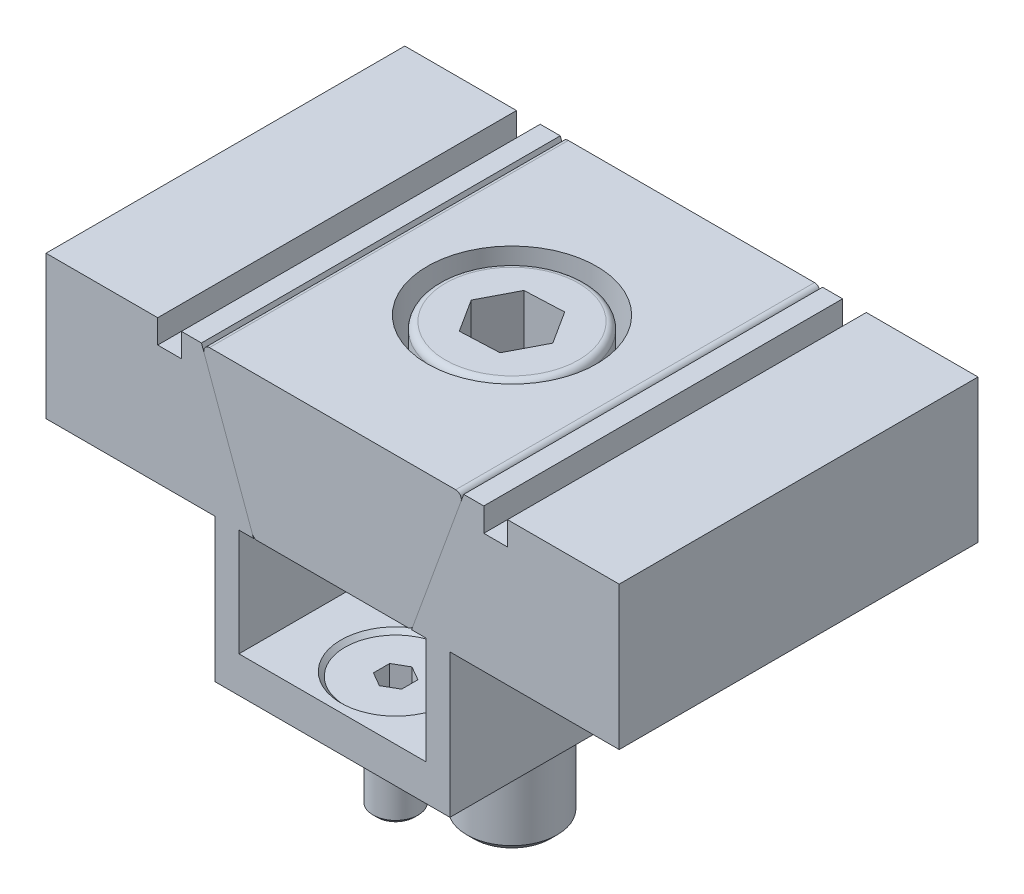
ISO-10303-21;
HEADER;
FILE_DESCRIPTION(('STEP AP214'),'2;1');
FILE_NAME('part.step','',(''),(''),'','','');
FILE_SCHEMA(('AUTOMOTIVE_DESIGN { 1 0 10303 214 1 1 1 1 }'));
ENDSEC;
DATA;
#1=APPLICATION_CONTEXT('core data for automotive mechanical design processes');
#2=APPLICATION_PROTOCOL_DEFINITION('international standard','automotive_design',2000,#1);
#3=PRODUCT_CONTEXT('',#1,'mechanical');
#4=PRODUCT('Part','Part','',(#3));
#5=PRODUCT_RELATED_PRODUCT_CATEGORY('part','',(#4));
#6=PRODUCT_DEFINITION_FORMATION('','',#4);
#7=PRODUCT_DEFINITION_CONTEXT('part definition',#1,'design');
#8=PRODUCT_DEFINITION('design','',#6,#7);
#9=PRODUCT_DEFINITION_SHAPE('','',#8);
#10=(LENGTH_UNIT() NAMED_UNIT(*) SI_UNIT(.MILLI.,.METRE.));
#11=(NAMED_UNIT(*) PLANE_ANGLE_UNIT() SI_UNIT($,.RADIAN.));
#12=(NAMED_UNIT(*) SI_UNIT($,.STERADIAN.) SOLID_ANGLE_UNIT());
#13=UNCERTAINTY_MEASURE_WITH_UNIT(LENGTH_MEASURE(1.E-05),#10,'distance_accuracy_value','');
#14=(GEOMETRIC_REPRESENTATION_CONTEXT(3) GLOBAL_UNCERTAINTY_ASSIGNED_CONTEXT((#13)) GLOBAL_UNIT_ASSIGNED_CONTEXT((#10,
#11,#12)) REPRESENTATION_CONTEXT('',''));
#15=CARTESIAN_POINT('',(0.,0.,0.));
#16=DIRECTION('',(0.,0.,1.));
#17=DIRECTION('',(1.,0.,0.));
#18=AXIS2_PLACEMENT_3D('',#15,#16,#17);
#19=CARTESIAN_POINT('',(0.,-12.3700000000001,8.86662432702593));
#20=DIRECTION('',(0.,1.,0.));
#21=DIRECTION('',(0.,0.,1.));
#22=AXIS2_PLACEMENT_3D('',#19,#20,#21);
#23=PLANE('',#22);
#24=DIRECTION('',(0.866025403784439,0.,0.5));
#25=VECTOR('',#24,1.);
#26=CARTESIAN_POINT('',(-1.25,-12.3700000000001,11.031687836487));
#27=LINE('',#26,#25);
#28=CARTESIAN_POINT('',(-1.25,-12.3700000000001,11.031687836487));
#29=VERTEX_POINT('',#28);
#30=CARTESIAN_POINT('',(-0.625000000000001,-12.3700000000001,11.3925317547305));
#31=VERTEX_POINT('',#30);
#32=EDGE_CURVE('P0_E127',#29,#31,#27,.T.);
#33=ORIENTED_EDGE('',*,*,#32,.T.);
#34=CARTESIAN_POINT('',(0.,-12.3700000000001,10.31));
#35=DIRECTION('',(0.,1.,0.));
#36=DIRECTION('',(0.,0.,1.));
#37=AXIS2_PLACEMENT_3D('',#34,#35,#36);
#38=CIRCLE('',#37,1.25);
#39=CARTESIAN_POINT('',(-1.25,-12.3700000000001,10.31));
#40=VERTEX_POINT('',#39);
#41=EDGE_CURVE('P0_E11',#31,#40,#38,.F.);
#42=ORIENTED_EDGE('',*,*,#41,.T.);
#43=DIRECTION('',(0.,0.,1.));
#44=VECTOR('',#43,1.);
#45=CARTESIAN_POINT('',(-1.25,-12.3700000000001,9.58831216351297));
#46=LINE('',#45,#44);
#47=EDGE_CURVE('P0_E122',#40,#29,#46,.T.);
#48=ORIENTED_EDGE('',*,*,#47,.T.);
#49=EDGE_LOOP('',(#33,#42,#48));
#50=FACE_BOUND('',#49,.T.);
#51=ADVANCED_FACE('P0_F16',(#50),#23,.T.);
#52=CARTESIAN_POINT('',(-1.25,-12.3700000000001,9.58831216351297));
#53=VERTEX_POINT('',#52);
#54=EDGE_CURVE('P0_E123',#53,#40,#46,.T.);
#55=ORIENTED_EDGE('',*,*,#54,.T.);
#56=CARTESIAN_POINT('',(-0.625,-12.3700000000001,9.22746824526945));
#57=VERTEX_POINT('',#56);
#58=EDGE_CURVE('P0_E25',#40,#57,#38,.F.);
#59=ORIENTED_EDGE('',*,*,#58,.T.);
#60=DIRECTION('',(-0.866025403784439,0.,0.5));
#61=VECTOR('',#60,1.);
#62=CARTESIAN_POINT('',(0.,-12.3700000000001,8.86662432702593));
#63=LINE('',#62,#61);
#64=EDGE_CURVE('P0_E119',#57,#53,#63,.T.);
#65=ORIENTED_EDGE('',*,*,#64,.T.);
#66=EDGE_LOOP('',(#55,#59,#65));
#67=FACE_BOUND('',#66,.T.);
#68=ADVANCED_FACE('P0_F210',(#67),#23,.T.);
#69=CARTESIAN_POINT('',(0.,-12.3700000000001,8.86662432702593));
#70=VERTEX_POINT('',#69);
#71=EDGE_CURVE('P0_E109',#70,#57,#63,.T.);
#72=ORIENTED_EDGE('',*,*,#71,.T.);
#73=CARTESIAN_POINT('',(0.625,-12.3700000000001,9.22746824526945));
#74=VERTEX_POINT('',#73);
#75=EDGE_CURVE('P0_E95',#57,#74,#38,.F.);
#76=ORIENTED_EDGE('',*,*,#75,.T.);
#77=DIRECTION('',(-0.866025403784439,0.,-0.5));
#78=VECTOR('',#77,1.);
#79=CARTESIAN_POINT('',(1.25,-12.3700000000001,9.58831216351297));
#80=LINE('',#79,#78);
#81=EDGE_CURVE('P0_E107',#74,#70,#80,.T.);
#82=ORIENTED_EDGE('',*,*,#81,.T.);
#83=EDGE_LOOP('',(#72,#76,#82));
#84=FACE_BOUND('',#83,.T.);
#85=ADVANCED_FACE('P0_F106',(#84),#23,.T.);
#86=CARTESIAN_POINT('',(1.25,-12.3700000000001,9.58831216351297));
#87=VERTEX_POINT('',#86);
#88=EDGE_CURVE('P0_E112',#87,#74,#80,.T.);
#89=ORIENTED_EDGE('',*,*,#88,.T.);
#90=CARTESIAN_POINT('',(0.,-12.3700000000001,10.31));
#91=DIRECTION('',(0.,-1.,0.));
#92=DIRECTION('',(0.,0.,-1.));
#93=AXIS2_PLACEMENT_3D('',#90,#91,#92);
#94=CIRCLE('',#93,1.25);
#95=CARTESIAN_POINT('',(1.25,-12.3700000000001,10.31));
#96=VERTEX_POINT('',#95);
#97=EDGE_CURVE('P0_E93',#74,#96,#94,.T.);
#98=ORIENTED_EDGE('',*,*,#97,.T.);
#99=DIRECTION('',(0.,0.,-1.));
#100=VECTOR('',#99,1.);
#101=CARTESIAN_POINT('',(1.25,-12.3700000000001,11.031687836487));
#102=LINE('',#101,#100);
#103=EDGE_CURVE('P0_E117',#96,#87,#102,.T.);
#104=ORIENTED_EDGE('',*,*,#103,.T.);
#105=EDGE_LOOP('',(#89,#98,#104));
#106=FACE_BOUND('',#105,.T.);
#107=ADVANCED_FACE('P0_F116',(#106),#23,.T.);
#108=CARTESIAN_POINT('',(1.25,-12.3700000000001,11.031687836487));
#109=VERTEX_POINT('',#108);
#110=EDGE_CURVE('P0_E134',#109,#96,#102,.T.);
#111=ORIENTED_EDGE('',*,*,#110,.T.);
#112=CARTESIAN_POINT('',(0.624999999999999,-12.3700000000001,11.3925317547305));
#113=VERTEX_POINT('',#112);
#114=EDGE_CURVE('P0_E98',#96,#113,#38,.F.);
#115=ORIENTED_EDGE('',*,*,#114,.T.);
#116=DIRECTION('',(0.866025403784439,0.,-0.5));
#117=VECTOR('',#116,1.);
#118=CARTESIAN_POINT('',(0.,-12.3700000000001,11.7533756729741));
#119=LINE('',#118,#117);
#120=EDGE_CURVE('P0_E130',#113,#109,#119,.T.);
#121=ORIENTED_EDGE('',*,*,#120,.T.);
#122=EDGE_LOOP('',(#111,#115,#121));
#123=FACE_BOUND('',#122,.T.);
#124=ADVANCED_FACE('P0_F179',(#123),#23,.T.);
#125=CARTESIAN_POINT('',(0.,-12.3700000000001,11.7533756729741));
#126=VERTEX_POINT('',#125);
#127=EDGE_CURVE('P0_E131',#126,#113,#119,.T.);
#128=ORIENTED_EDGE('',*,*,#127,.T.);
#129=EDGE_CURVE('P0_E20',#113,#31,#38,.F.);
#130=ORIENTED_EDGE('',*,*,#129,.T.);
#131=EDGE_CURVE('P0_E126',#31,#126,#27,.T.);
#132=ORIENTED_EDGE('',*,*,#131,.T.);
#133=EDGE_LOOP('',(#128,#130,#132));
#134=FACE_BOUND('',#133,.T.);
#135=ADVANCED_FACE('P0_F185',(#134),#23,.T.);
#136=CARTESIAN_POINT('',(0.,-19.8700000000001,10.31));
#137=DIRECTION('',(0.,1.,0.));
#138=DIRECTION('',(0.,0.,1.));
#139=AXIS2_PLACEMENT_3D('',#136,#137,#138);
#140=CYLINDRICAL_SURFACE('',#139,2.);
#141=CARTESIAN_POINT('',(0.,-19.5200000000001,10.31));
#142=DIRECTION('',(0.,1.,0.));
#143=DIRECTION('',(0.,0.,1.));
#144=AXIS2_PLACEMENT_3D('',#141,#142,#143);
#145=CIRCLE('',#144,2.);
#146=CARTESIAN_POINT('',(0.,-19.5200000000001,12.31));
#147=VERTEX_POINT('',#146);
#148=EDGE_CURVE('P0_E169',#147,#147,#145,.T.);
#149=ORIENTED_EDGE('',*,*,#148,.T.);
#150=EDGE_LOOP('',(#149));
#151=FACE_BOUND('',#150,.T.);
#152=CARTESIAN_POINT('',(0.,-12.35,10.31));
#153=DIRECTION('',(0.,1.,0.));
#154=DIRECTION('',(0.,0.,1.));
#155=AXIS2_PLACEMENT_3D('',#152,#153,#154);
#156=CIRCLE('',#155,2.);
#157=CARTESIAN_POINT('',(0.,-12.35,12.31));
#158=VERTEX_POINT('',#157);
#159=EDGE_CURVE('P0_E166',#158,#158,#156,.F.);
#160=ORIENTED_EDGE('',*,*,#159,.T.);
#161=EDGE_LOOP('',(#160));
#162=FACE_BOUND('',#161,.T.);
#163=ADVANCED_FACE('P0_F217',(#151,#162),#140,.T.);
#164=CARTESIAN_POINT('',(0.,-19.8700000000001,10.31));
#165=DIRECTION('',(0.,1.,0.));
#166=DIRECTION('',(0.,0.,1.));
#167=AXIS2_PLACEMENT_3D('',#164,#165,#166);
#168=PLANE('',#167);
#169=CARTESIAN_POINT('',(0.,-19.8700000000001,10.31));
#170=DIRECTION('',(0.,1.,0.));
#171=DIRECTION('',(0.,0.,1.));
#172=AXIS2_PLACEMENT_3D('',#169,#170,#171);
#173=CIRCLE('',#172,1.65);
#174=CARTESIAN_POINT('',(0.,-19.8700000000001,11.96));
#175=VERTEX_POINT('',#174);
#176=EDGE_CURVE('P0_E171',#175,#175,#173,.F.);
#177=ORIENTED_EDGE('',*,*,#176,.T.);
#178=EDGE_LOOP('',(#177));
#179=FACE_BOUND('',#178,.T.);
#180=ADVANCED_FACE('P0_F222',(#179),#168,.F.);
#181=CARTESIAN_POINT('',(0.,-9.87000000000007,10.31));
#182=DIRECTION('',(0.,1.,0.));
#183=DIRECTION('',(0.,0.,1.));
#184=AXIS2_PLACEMENT_3D('',#181,#182,#183);
#185=CONICAL_SURFACE('',#184,4.48,0.785398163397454);
#186=ORIENTED_EDGE('',*,*,#159,.F.);
#187=EDGE_LOOP('',(#186));
#188=FACE_BOUND('',#187,.T.);
#189=CARTESIAN_POINT('',(0.,-9.87000000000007,10.31));
#190=DIRECTION('',(0.,-1.,0.));
#191=DIRECTION('',(0.,0.,-1.));
#192=AXIS2_PLACEMENT_3D('',#189,#190,#191);
#193=CIRCLE('',#192,4.48);
#194=CARTESIAN_POINT('',(0.,-9.87000000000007,5.83));
#195=VERTEX_POINT('',#194);
#196=EDGE_CURVE('P0_E154',#195,#195,#193,.T.);
#197=ORIENTED_EDGE('',*,*,#196,.T.);
#198=EDGE_LOOP('',(#197));
#199=FACE_BOUND('',#198,.T.);
#200=ADVANCED_FACE('P0_F277',(#188,#199),#185,.T.);
#201=CARTESIAN_POINT('',(0.,-9.87000000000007,10.31));
#202=DIRECTION('',(0.,1.,0.));
#203=DIRECTION('',(0.,0.,1.));
#204=AXIS2_PLACEMENT_3D('',#201,#202,#203);
#205=PLANE('',#204);
#206=DIRECTION('',(-0.866025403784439,0.,-0.5));
#207=VECTOR('',#206,1.);
#208=CARTESIAN_POINT('',(1.25,-9.87000000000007,9.58831216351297));
#209=LINE('',#208,#207);
#210=CARTESIAN_POINT('',(1.25,-9.87000000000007,9.58831216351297));
#211=VERTEX_POINT('',#210);
#212=CARTESIAN_POINT('',(0.,-9.87000000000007,8.86662432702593));
#213=VERTEX_POINT('',#212);
#214=EDGE_CURVE('P0_E38',#211,#213,#209,.T.);
#215=ORIENTED_EDGE('',*,*,#214,.F.);
#216=DIRECTION('',(0.,0.,-1.));
#217=VECTOR('',#216,1.);
#218=CARTESIAN_POINT('',(1.25,-9.87000000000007,11.031687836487));
#219=LINE('',#218,#217);
#220=CARTESIAN_POINT('',(1.25,-9.87000000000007,11.031687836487));
#221=VERTEX_POINT('',#220);
#222=EDGE_CURVE('P0_E114',#221,#211,#219,.T.);
#223=ORIENTED_EDGE('',*,*,#222,.F.);
#224=DIRECTION('',(0.866025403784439,0.,-0.5));
#225=VECTOR('',#224,1.);
#226=CARTESIAN_POINT('',(0.,-9.87000000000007,11.7533756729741));
#227=LINE('',#226,#225);
#228=CARTESIAN_POINT('',(0.,-9.87000000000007,11.7533756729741));
#229=VERTEX_POINT('',#228);
#230=EDGE_CURVE('P0_E147',#229,#221,#227,.T.);
#231=ORIENTED_EDGE('',*,*,#230,.F.);
#232=DIRECTION('',(0.866025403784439,0.,0.5));
#233=VECTOR('',#232,1.);
#234=CARTESIAN_POINT('',(-1.25,-9.87000000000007,11.031687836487));
#235=LINE('',#234,#233);
#236=CARTESIAN_POINT('',(-1.25,-9.87000000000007,11.031687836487));
#237=VERTEX_POINT('',#236);
#238=EDGE_CURVE('P0_E144',#237,#229,#235,.T.);
#239=ORIENTED_EDGE('',*,*,#238,.F.);
#240=DIRECTION('',(0.,0.,1.));
#241=VECTOR('',#240,1.);
#242=CARTESIAN_POINT('',(-1.25,-9.87000000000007,9.58831216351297));
#243=LINE('',#242,#241);
#244=CARTESIAN_POINT('',(-1.25,-9.87000000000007,9.58831216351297));
#245=VERTEX_POINT('',#244);
#246=EDGE_CURVE('P0_E141',#245,#237,#243,.T.);
#247=ORIENTED_EDGE('',*,*,#246,.F.);
#248=DIRECTION('',(-0.866025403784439,0.,0.5));
#249=VECTOR('',#248,1.);
#250=CARTESIAN_POINT('',(0.,-9.87000000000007,8.86662432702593));
#251=LINE('',#250,#249);
#252=EDGE_CURVE('P0_E138',#213,#245,#251,.T.);
#253=ORIENTED_EDGE('',*,*,#252,.F.);
#254=EDGE_LOOP('',(#215,#223,#231,#239,#247,#253));
#255=FACE_BOUND('',#254,.T.);
#256=ORIENTED_EDGE('',*,*,#196,.F.);
#257=EDGE_LOOP('',(#256));
#258=FACE_BOUND('',#257,.T.);
#259=ADVANCED_FACE('P0_F194',(#255,#258),#205,.T.);
#260=CARTESIAN_POINT('',(0.,-19.5200000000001,10.31));
#261=DIRECTION('',(0.,1.,0.));
#262=DIRECTION('',(0.,0.,1.));
#263=AXIS2_PLACEMENT_3D('',#260,#261,#262);
#264=CONICAL_SURFACE('',#263,2.,0.785398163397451);
#265=CARTESIAN_POINT('',(0.,-19.8700000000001,11.96));
#266=CARTESIAN_POINT('',(0.,-19.8663541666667,11.9636458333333));
#267=CARTESIAN_POINT('',(0.,-19.8627083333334,11.9672916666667));
#268=CARTESIAN_POINT('',(0.,-19.8554166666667,11.9745833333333));
#269=CARTESIAN_POINT('',(0.,-19.8517708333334,11.9782291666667));
#270=CARTESIAN_POINT('',(0.,-19.8444791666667,11.9855208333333));
#271=CARTESIAN_POINT('',(0.,-19.8408333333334,11.9891666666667));
#272=CARTESIAN_POINT('',(0.,-19.8335416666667,11.9964583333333));
#273=CARTESIAN_POINT('',(0.,-19.8298958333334,12.0001041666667));
#274=CARTESIAN_POINT('',(0.,-19.8226041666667,12.0073958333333));
#275=CARTESIAN_POINT('',(0.,-19.8189583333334,12.0110416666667));
#276=CARTESIAN_POINT('',(0.,-19.8116666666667,12.0183333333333));
#277=CARTESIAN_POINT('',(0.,-19.8080208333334,12.0219791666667));
#278=CARTESIAN_POINT('',(0.,-19.8007291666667,12.0292708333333));
#279=CARTESIAN_POINT('',(0.,-19.7970833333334,12.0329166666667));
#280=CARTESIAN_POINT('',(0.,-19.7897916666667,12.0402083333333));
#281=CARTESIAN_POINT('',(0.,-19.7861458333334,12.0438541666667));
#282=CARTESIAN_POINT('',(0.,-19.7788541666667,12.0511458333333));
#283=CARTESIAN_POINT('',(0.,-19.7752083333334,12.0547916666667));
#284=CARTESIAN_POINT('',(0.,-19.7679166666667,12.0620833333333));
#285=CARTESIAN_POINT('',(0.,-19.7642708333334,12.0657291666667));
#286=CARTESIAN_POINT('',(0.,-19.7569791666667,12.0730208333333));
#287=CARTESIAN_POINT('',(0.,-19.7533333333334,12.0766666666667));
#288=CARTESIAN_POINT('',(0.,-19.7460416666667,12.0839583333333));
#289=CARTESIAN_POINT('',(0.,-19.7423958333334,12.0876041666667));
#290=CARTESIAN_POINT('',(0.,-19.7351041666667,12.0948958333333));
#291=CARTESIAN_POINT('',(0.,-19.7314583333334,12.0985416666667));
#292=CARTESIAN_POINT('',(0.,-19.7241666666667,12.1058333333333));
#293=CARTESIAN_POINT('',(0.,-19.7205208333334,12.1094791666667));
#294=CARTESIAN_POINT('',(0.,-19.7132291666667,12.1167708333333));
#295=CARTESIAN_POINT('',(0.,-19.7095833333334,12.1204166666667));
#296=CARTESIAN_POINT('',(0.,-19.7022916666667,12.1277083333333));
#297=CARTESIAN_POINT('',(0.,-19.6986458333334,12.1313541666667));
#298=CARTESIAN_POINT('',(0.,-19.6913541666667,12.1386458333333));
#299=CARTESIAN_POINT('',(0.,-19.6877083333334,12.1422916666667));
#300=CARTESIAN_POINT('',(0.,-19.6804166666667,12.1495833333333));
#301=CARTESIAN_POINT('',(0.,-19.6767708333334,12.1532291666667));
#302=CARTESIAN_POINT('',(0.,-19.6694791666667,12.1605208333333));
#303=CARTESIAN_POINT('',(0.,-19.6658333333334,12.1641666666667));
#304=CARTESIAN_POINT('',(0.,-19.6585416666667,12.1714583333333));
#305=CARTESIAN_POINT('',(0.,-19.6548958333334,12.1751041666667));
#306=CARTESIAN_POINT('',(0.,-19.6476041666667,12.1823958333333));
#307=CARTESIAN_POINT('',(0.,-19.6439583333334,12.1860416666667));
#308=CARTESIAN_POINT('',(0.,-19.6366666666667,12.1933333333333));
#309=CARTESIAN_POINT('',(0.,-19.6330208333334,12.1969791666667));
#310=CARTESIAN_POINT('',(0.,-19.6257291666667,12.2042708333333));
#311=CARTESIAN_POINT('',(0.,-19.6220833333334,12.2079166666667));
#312=CARTESIAN_POINT('',(0.,-19.6147916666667,12.2152083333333));
#313=CARTESIAN_POINT('',(0.,-19.6111458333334,12.2188541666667));
#314=CARTESIAN_POINT('',(0.,-19.6038541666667,12.2261458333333));
#315=CARTESIAN_POINT('',(0.,-19.6002083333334,12.2297916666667));
#316=CARTESIAN_POINT('',(0.,-19.5929166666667,12.2370833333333));
#317=CARTESIAN_POINT('',(0.,-19.5892708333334,12.2407291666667));
#318=CARTESIAN_POINT('',(0.,-19.5819791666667,12.2480208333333));
#319=CARTESIAN_POINT('',(0.,-19.5783333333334,12.2516666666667));
#320=CARTESIAN_POINT('',(0.,-19.5710416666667,12.2589583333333));
#321=CARTESIAN_POINT('',(0.,-19.5673958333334,12.2626041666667));
#322=CARTESIAN_POINT('',(0.,-19.5601041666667,12.2698958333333));
#323=CARTESIAN_POINT('',(0.,-19.5564583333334,12.2735416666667));
#324=CARTESIAN_POINT('',(0.,-19.5491666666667,12.2808333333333));
#325=CARTESIAN_POINT('',(0.,-19.5455208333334,12.2844791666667));
#326=CARTESIAN_POINT('',(0.,-19.5382291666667,12.2917708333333));
#327=CARTESIAN_POINT('',(0.,-19.5345833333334,12.2954166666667));
#328=CARTESIAN_POINT('',(0.,-19.5272916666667,12.3027083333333));
#329=CARTESIAN_POINT('',(0.,-19.5236458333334,12.3063541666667));
#330=CARTESIAN_POINT('',(0.,-19.5200000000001,12.31));
#331=B_SPLINE_CURVE_WITH_KNOTS('',3,(#265,#266,#267,#268,#269,#270,#271,#272,#273,#274,#275,
#276,#277,#278,#279,#280,#281,#282,#283,#284,#285,#286,#287,#288,#289,#290,#291,#292,#293,#294,
#295,#296,#297,#298,#299,#300,#301,#302,#303,#304,#305,#306,#307,#308,#309,#310,#311,#312,#313,
#314,#315,#316,#317,#318,#319,#320,#321,#322,#323,#324,#325,#326,#327,#328,#329,#330),
.UNSPECIFIED.,.F.,.F.,(4,2,2,2,2,2,2,2,2,2,2,2,2,2,2,2,2,2,2,2,2,2,2,2,2,2,2,2,2,2,2,2,4),(0.,
0.0154679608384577,0.0309359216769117,0.0464038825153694,0.0618718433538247,0.0773398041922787,
0.0928077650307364,0.108275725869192,0.123743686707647,0.139211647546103,0.154679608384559,
0.170147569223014,0.185615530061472,0.201083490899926,0.216551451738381,0.232019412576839,
0.247487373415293,0.262955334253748,0.278423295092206,0.293891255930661,0.309359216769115,
0.324827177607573,0.340295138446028,0.355763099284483,0.37123106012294,0.386699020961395,
0.40216698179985,0.417634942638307,0.433102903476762,0.448570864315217,0.464038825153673,
0.479506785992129,0.494974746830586),.UNSPECIFIED.);
#332=EDGE_CURVE('P0_BSEAM18',#175,#147,#331,.T.);
#333=ORIENTED_EDGE('',*,*,#176,.F.);
#334=ORIENTED_EDGE('',*,*,#148,.F.);
#335=ORIENTED_EDGE('',*,*,#332,.T.);
#336=ORIENTED_EDGE('',*,*,#332,.F.);
#337=EDGE_LOOP('',(#333,#335,#334,#336));
#338=FACE_BOUND('',#337,.T.);
#339=ADVANCED_FACE('P0_F18',(#338),#264,.T.);
#340=CARTESIAN_POINT('',(1.25,-12.3700000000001,9.58831216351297));
#341=DIRECTION('',(0.5,0.,-0.866025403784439));
#342=DIRECTION('',(-0.866025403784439,0.,-0.5));
#343=AXIS2_PLACEMENT_3D('',#340,#341,#342);
#344=PLANE('',#343);
#345=ORIENTED_EDGE('',*,*,#214,.T.);
#346=DIRECTION('',(0.,1.,0.));
#347=VECTOR('',#346,1.);
#348=CARTESIAN_POINT('',(0.,-12.3700000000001,8.86662432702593));
#349=LINE('',#348,#347);
#350=EDGE_CURVE('P0_E113',#70,#213,#349,.T.);
#351=ORIENTED_EDGE('',*,*,#350,.F.);
#352=ORIENTED_EDGE('',*,*,#81,.F.);
#353=ORIENTED_EDGE('',*,*,#88,.F.);
#354=DIRECTION('',(0.,1.,0.));
#355=VECTOR('',#354,1.);
#356=CARTESIAN_POINT('',(1.25,-12.3700000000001,9.58831216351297));
#357=LINE('',#356,#355);
#358=EDGE_CURVE('P0_E152',#87,#211,#357,.T.);
#359=ORIENTED_EDGE('',*,*,#358,.T.);
#360=EDGE_LOOP('',(#345,#351,#352,#353,#359));
#361=FACE_BOUND('',#360,.T.);
#362=ADVANCED_FACE('P0_F111',(#361),#344,.F.);
#363=CARTESIAN_POINT('',(1.25,-12.3700000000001,11.031687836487));
#364=DIRECTION('',(1.,0.,0.));
#365=DIRECTION('',(0.,0.,-1.));
#366=AXIS2_PLACEMENT_3D('',#363,#364,#365);
#367=PLANE('',#366);
#368=ORIENTED_EDGE('',*,*,#222,.T.);
#369=ORIENTED_EDGE('',*,*,#358,.F.);
#370=ORIENTED_EDGE('',*,*,#103,.F.);
#371=ORIENTED_EDGE('',*,*,#110,.F.);
#372=DIRECTION('',(0.,1.,0.));
#373=VECTOR('',#372,1.);
#374=CARTESIAN_POINT('',(1.25,-12.3700000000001,11.031687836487));
#375=LINE('',#374,#373);
#376=EDGE_CURVE('P0_E155',#109,#221,#375,.T.);
#377=ORIENTED_EDGE('',*,*,#376,.T.);
#378=EDGE_LOOP('',(#368,#369,#370,#371,#377));
#379=FACE_BOUND('',#378,.T.);
#380=ADVANCED_FACE('P0_F198',(#379),#367,.F.);
#381=CARTESIAN_POINT('',(0.,-12.3700000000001,11.7533756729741));
#382=DIRECTION('',(0.5,0.,0.866025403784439));
#383=DIRECTION('',(0.866025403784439,0.,-0.5));
#384=AXIS2_PLACEMENT_3D('',#381,#382,#383);
#385=PLANE('',#384);
#386=ORIENTED_EDGE('',*,*,#230,.T.);
#387=ORIENTED_EDGE('',*,*,#376,.F.);
#388=ORIENTED_EDGE('',*,*,#120,.F.);
#389=ORIENTED_EDGE('',*,*,#127,.F.);
#390=DIRECTION('',(0.,1.,0.));
#391=VECTOR('',#390,1.);
#392=CARTESIAN_POINT('',(0.,-12.3700000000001,11.7533756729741));
#393=LINE('',#392,#391);
#394=EDGE_CURVE('P0_E157',#126,#229,#393,.T.);
#395=ORIENTED_EDGE('',*,*,#394,.T.);
#396=EDGE_LOOP('',(#386,#387,#388,#389,#395));
#397=FACE_BOUND('',#396,.T.);
#398=ADVANCED_FACE('P0_F184',(#397),#385,.F.);
#399=CARTESIAN_POINT('',(-1.25,-12.3700000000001,11.031687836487));
#400=DIRECTION('',(-0.5,0.,0.866025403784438));
#401=DIRECTION('',(0.866025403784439,0.,0.5));
#402=AXIS2_PLACEMENT_3D('',#399,#400,#401);
#403=PLANE('',#402);
#404=ORIENTED_EDGE('',*,*,#238,.T.);
#405=ORIENTED_EDGE('',*,*,#394,.F.);
#406=ORIENTED_EDGE('',*,*,#131,.F.);
#407=ORIENTED_EDGE('',*,*,#32,.F.);
#408=DIRECTION('',(0.,1.,0.));
#409=VECTOR('',#408,1.);
#410=CARTESIAN_POINT('',(-1.25,-12.3700000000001,11.031687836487));
#411=LINE('',#410,#409);
#412=EDGE_CURVE('P0_E159',#29,#237,#411,.T.);
#413=ORIENTED_EDGE('',*,*,#412,.T.);
#414=EDGE_LOOP('',(#404,#405,#406,#407,#413));
#415=FACE_BOUND('',#414,.T.);
#416=ADVANCED_FACE('P0_F189',(#415),#403,.F.);
#417=CARTESIAN_POINT('',(-1.25,-12.3700000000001,9.58831216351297));
#418=DIRECTION('',(-1.,0.,0.));
#419=DIRECTION('',(0.,0.,1.));
#420=AXIS2_PLACEMENT_3D('',#417,#418,#419);
#421=PLANE('',#420);
#422=ORIENTED_EDGE('',*,*,#246,.T.);
#423=ORIENTED_EDGE('',*,*,#412,.F.);
#424=ORIENTED_EDGE('',*,*,#47,.F.);
#425=ORIENTED_EDGE('',*,*,#54,.F.);
#426=DIRECTION('',(0.,1.,0.));
#427=VECTOR('',#426,1.);
#428=CARTESIAN_POINT('',(-1.25,-12.3700000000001,9.58831216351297));
#429=LINE('',#428,#427);
#430=EDGE_CURVE('P0_E161',#53,#245,#429,.T.);
#431=ORIENTED_EDGE('',*,*,#430,.T.);
#432=EDGE_LOOP('',(#422,#423,#424,#425,#431));
#433=FACE_BOUND('',#432,.T.);
#434=ADVANCED_FACE('P0_F321',(#433),#421,.F.);
#435=CARTESIAN_POINT('',(0.,-12.3700000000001,8.86662432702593));
#436=DIRECTION('',(-0.5,0.,-0.866025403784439));
#437=DIRECTION('',(-0.866025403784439,0.,0.5));
#438=AXIS2_PLACEMENT_3D('',#435,#436,#437);
#439=PLANE('',#438);
#440=ORIENTED_EDGE('',*,*,#252,.T.);
#441=ORIENTED_EDGE('',*,*,#430,.F.);
#442=ORIENTED_EDGE('',*,*,#64,.F.);
#443=ORIENTED_EDGE('',*,*,#71,.F.);
#444=ORIENTED_EDGE('',*,*,#350,.T.);
#445=EDGE_LOOP('',(#440,#441,#442,#443,#444));
#446=FACE_BOUND('',#445,.T.);
#447=ADVANCED_FACE('P0_F90',(#446),#439,.F.);
#448=CARTESIAN_POINT('',(0.,-12.3700000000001,10.31));
#449=DIRECTION('',(0.,1.,0.));
#450=DIRECTION('',(0.,0.,1.));
#451=AXIS2_PLACEMENT_3D('',#448,#449,#450);
#452=CONICAL_SURFACE('',#451,1.25,1.0471975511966);
#453=CARTESIAN_POINT('',(0.,-13.0916878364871,10.31));
#454=VERTEX_POINT('',#453);
#455=VERTEX_LOOP('',#454);
#456=FACE_BOUND('',#455,.T.);
#457=ORIENTED_EDGE('',*,*,#97,.F.);
#458=ORIENTED_EDGE('',*,*,#75,.F.);
#459=ORIENTED_EDGE('',*,*,#58,.F.);
#460=ORIENTED_EDGE('',*,*,#41,.F.);
#461=ORIENTED_EDGE('',*,*,#129,.F.);
#462=ORIENTED_EDGE('',*,*,#114,.F.);
#463=EDGE_LOOP('',(#457,#458,#459,#460,#461,#462));
#464=FACE_BOUND('',#463,.T.);
#465=ADVANCED_FACE('P0_F88',(#456,#464),#452,.F.);
#466=CLOSED_SHELL('',(#51,#68,#85,#107,#124,#135,#163,#180,#200,#259,#339,#362,#380,#398,#416,
#434,#447,#465));
#467=MANIFOLD_SOLID_BREP('P0_B1',#466);
#468=CARTESIAN_POINT('',(0.,4.20000000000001,0.));
#469=DIRECTION('',(0.,-1.,0.));
#470=DIRECTION('',(-0.887264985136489,0.,-0.461260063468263));
#471=AXIS2_PLACEMENT_3D('',#468,#469,#470);
#472=CYLINDRICAL_SURFACE('',#471,4.);
#473=CARTESIAN_POINT('',(0.,-25.2,0.));
#474=DIRECTION('',(0.,1.,0.));
#475=DIRECTION('',(0.887264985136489,0.,0.461260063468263));
#476=AXIS2_PLACEMENT_3D('',#473,#474,#475);
#477=CIRCLE('',#476,4.);
#478=CARTESIAN_POINT('',(3.54905994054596,-25.2,1.84504025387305));
#479=VERTEX_POINT('',#478);
#480=EDGE_CURVE('P1_E24',#479,#479,#477,.T.);
#481=ORIENTED_EDGE('',*,*,#480,.T.);
#482=EDGE_LOOP('',(#481));
#483=FACE_BOUND('',#482,.T.);
#484=CARTESIAN_POINT('',(0.,4.20000000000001,0.));
#485=DIRECTION('',(0.,1.,0.));
#486=DIRECTION('',(0.887264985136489,0.,0.461260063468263));
#487=AXIS2_PLACEMENT_3D('',#484,#485,#486);
#488=CIRCLE('',#487,4.);
#489=CARTESIAN_POINT('',(3.54905994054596,4.20000000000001,1.84504025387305));
#490=VERTEX_POINT('',#489);
#491=EDGE_CURVE('P1_E126',#490,#490,#488,.T.);
#492=ORIENTED_EDGE('',*,*,#491,.F.);
#493=EDGE_LOOP('',(#492));
#494=FACE_BOUND('',#493,.T.);
#495=ADVANCED_FACE('P1_F16',(#483,#494),#472,.T.);
#496=CARTESIAN_POINT('',(0.,-25.8,0.));
#497=DIRECTION('',(0.,1.,0.));
#498=DIRECTION('',(0.887264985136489,0.,0.461260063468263));
#499=AXIS2_PLACEMENT_3D('',#496,#497,#498);
#500=PLANE('',#499);
#501=CARTESIAN_POINT('',(0.,-25.8,0.));
#502=DIRECTION('',(0.,1.,0.));
#503=DIRECTION('',(0.887264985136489,0.,0.461260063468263));
#504=AXIS2_PLACEMENT_3D('',#501,#502,#503);
#505=CIRCLE('',#504,3.39999999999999);
#506=CARTESIAN_POINT('',(3.01670094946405,-25.8,1.56828421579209));
#507=VERTEX_POINT('',#506);
#508=EDGE_CURVE('P1_E11',#507,#507,#505,.F.);
#509=ORIENTED_EDGE('',*,*,#508,.T.);
#510=EDGE_LOOP('',(#509));
#511=FACE_BOUND('',#510,.T.);
#512=ADVANCED_FACE('P1_F149',(#511),#500,.F.);
#513=CARTESIAN_POINT('',(0.,4.20000000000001,0.));
#514=DIRECTION('',(0.,1.,0.));
#515=DIRECTION('',(0.887264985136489,0.,0.461260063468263));
#516=AXIS2_PLACEMENT_3D('',#513,#514,#515);
#517=PLANE('',#516);
#518=CARTESIAN_POINT('',(0.,4.20000000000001,0.));
#519=DIRECTION('',(0.,1.,0.));
#520=DIRECTION('',(0.887264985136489,0.,0.461260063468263));
#521=AXIS2_PLACEMENT_3D('',#518,#519,#520);
#522=CIRCLE('',#521,6.5);
#523=CARTESIAN_POINT('',(5.76722240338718,4.20000000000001,2.99819041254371));
#524=VERTEX_POINT('',#523);
#525=EDGE_CURVE('P1_E118',#524,#524,#522,.T.);
#526=ORIENTED_EDGE('',*,*,#525,.F.);
#527=EDGE_LOOP('',(#526));
#528=FACE_BOUND('',#527,.T.);
#529=ORIENTED_EDGE('',*,*,#491,.T.);
#530=EDGE_LOOP('',(#529));
#531=FACE_BOUND('',#530,.T.);
#532=ADVANCED_FACE('P1_F154',(#528,#531),#517,.F.);
#533=CARTESIAN_POINT('',(0.,12.2,0.));
#534=DIRECTION('',(0.,-1.,0.));
#535=DIRECTION('',(-0.887264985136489,0.,-0.461260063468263));
#536=AXIS2_PLACEMENT_3D('',#533,#534,#535);
#537=CYLINDRICAL_SURFACE('',#536,6.5);
#538=CARTESIAN_POINT('',(0.,11.6,0.));
#539=DIRECTION('',(0.,1.,0.));
#540=DIRECTION('',(0.887264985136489,0.,0.461260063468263));
#541=AXIS2_PLACEMENT_3D('',#538,#539,#540);
#542=CIRCLE('',#541,6.5);
#543=CARTESIAN_POINT('',(5.76722240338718,11.6,2.99819041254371));
#544=VERTEX_POINT('',#543);
#545=EDGE_CURVE('P1_E132',#544,#544,#542,.F.);
#546=ORIENTED_EDGE('',*,*,#545,.T.);
#547=EDGE_LOOP('',(#546));
#548=FACE_BOUND('',#547,.T.);
#549=ORIENTED_EDGE('',*,*,#525,.T.);
#550=EDGE_LOOP('',(#549));
#551=FACE_BOUND('',#550,.T.);
#552=ADVANCED_FACE('P1_F158',(#548,#551),#537,.T.);
#553=CARTESIAN_POINT('',(0.,12.2,0.));
#554=DIRECTION('',(0.,1.,0.));
#555=DIRECTION('',(0.887264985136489,0.,0.461260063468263));
#556=AXIS2_PLACEMENT_3D('',#553,#554,#555);
#557=PLANE('',#556);
#558=CARTESIAN_POINT('',(0.,12.2,0.));
#559=DIRECTION('',(0.,1.,0.));
#560=DIRECTION('',(0.887264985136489,0.,0.461260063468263));
#561=AXIS2_PLACEMENT_3D('',#558,#559,#560);
#562=CIRCLE('',#561,5.9);
#563=CARTESIAN_POINT('',(5.23486341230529,12.2,2.72143437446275));
#564=VERTEX_POINT('',#563);
#565=EDGE_CURVE('P1_E129',#564,#564,#562,.T.);
#566=ORIENTED_EDGE('',*,*,#565,.T.);
#567=EDGE_LOOP('',(#566));
#568=FACE_BOUND('',#567,.T.);
#569=DIRECTION('',(-0.999024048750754,0.,0.0441695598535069));
#570=VECTOR('',#569,1.);
#571=CARTESIAN_POINT('',(1.59785173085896,12.2,-3.07357606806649));
#572=LINE('',#571,#570);
#573=CARTESIAN_POINT('',(1.59785173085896,12.2,-3.07357606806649));
#574=VERTEX_POINT('',#573);
#575=CARTESIAN_POINT('',(-1.86286908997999,12.2,-2.92056822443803));
#576=VERTEX_POINT('',#575);
#577=EDGE_CURVE('P1_E31',#574,#576,#572,.T.);
#578=ORIENTED_EDGE('',*,*,#577,.F.);
#579=DIRECTION('',(-0.537763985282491,0.,-0.843095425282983));
#580=VECTOR('',#579,1.);
#581=CARTESIAN_POINT('',(3.46072082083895,12.2,-0.153007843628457));
#582=LINE('',#581,#580);
#583=CARTESIAN_POINT('',(3.46072082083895,12.2,-0.153007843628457));
#584=VERTEX_POINT('',#583);
#585=EDGE_CURVE('P1_E114',#584,#574,#582,.T.);
#586=ORIENTED_EDGE('',*,*,#585,.F.);
#587=DIRECTION('',(0.461260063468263,0.,-0.887264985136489));
#588=VECTOR('',#587,1.);
#589=CARTESIAN_POINT('',(1.86286908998,12.2,2.92056822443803));
#590=LINE('',#589,#588);
#591=CARTESIAN_POINT('',(1.86286908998,12.2,2.92056822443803));
#592=VERTEX_POINT('',#591);
#593=EDGE_CURVE('P1_E112',#592,#584,#590,.T.);
#594=ORIENTED_EDGE('',*,*,#593,.F.);
#595=DIRECTION('',(0.999024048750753,0.,-0.0441695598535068));
#596=VECTOR('',#595,1.);
#597=CARTESIAN_POINT('',(-1.59785173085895,12.2,3.07357606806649));
#598=LINE('',#597,#596);
#599=CARTESIAN_POINT('',(-1.59785173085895,12.2,3.07357606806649));
#600=VERTEX_POINT('',#599);
#601=EDGE_CURVE('P1_E79',#600,#592,#598,.T.);
#602=ORIENTED_EDGE('',*,*,#601,.F.);
#603=DIRECTION('',(0.537763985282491,0.,0.843095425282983));
#604=VECTOR('',#603,1.);
#605=CARTESIAN_POINT('',(-3.46072082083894,12.2,0.153007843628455));
#606=LINE('',#605,#604);
#607=CARTESIAN_POINT('',(-3.46072082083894,12.2,0.153007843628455));
#608=VERTEX_POINT('',#607);
#609=EDGE_CURVE('P1_E108',#608,#600,#606,.T.);
#610=ORIENTED_EDGE('',*,*,#609,.F.);
#611=DIRECTION('',(-0.461260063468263,0.,0.887264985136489));
#612=VECTOR('',#611,1.);
#613=CARTESIAN_POINT('',(-1.86286908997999,12.2,-2.92056822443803));
#614=LINE('',#613,#612);
#615=EDGE_CURVE('P1_E105',#576,#608,#614,.T.);
#616=ORIENTED_EDGE('',*,*,#615,.F.);
#617=EDGE_LOOP('',(#578,#586,#594,#602,#610,#616));
#618=FACE_BOUND('',#617,.T.);
#619=ADVANCED_FACE('P1_F161',(#568,#618),#557,.T.);
#620=CARTESIAN_POINT('',(1.59785173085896,6.20000000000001,-3.07357606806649));
#621=DIRECTION('',(-0.0441695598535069,0.,-0.999024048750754));
#622=DIRECTION('',(-0.999024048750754,0.,0.0441695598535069));
#623=AXIS2_PLACEMENT_3D('',#620,#621,#622);
#624=PLANE('',#623);
#625=ORIENTED_EDGE('',*,*,#577,.T.);
#626=DIRECTION('',(0.,1.,0.));
#627=VECTOR('',#626,1.);
#628=CARTESIAN_POINT('',(-1.86286908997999,6.20000000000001,-2.92056822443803));
#629=LINE('',#628,#627);
#630=CARTESIAN_POINT('',(-1.86286908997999,6.20000000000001,-2.92056822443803));
#631=VERTEX_POINT('',#630);
#632=EDGE_CURVE('P1_E61',#631,#576,#629,.T.);
#633=ORIENTED_EDGE('',*,*,#632,.F.);
#634=DIRECTION('',(-0.999024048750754,0.,0.0441695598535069));
#635=VECTOR('',#634,1.);
#636=CARTESIAN_POINT('',(1.59785173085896,6.20000000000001,-3.07357606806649));
#637=LINE('',#636,#635);
#638=CARTESIAN_POINT('',(1.59785173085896,6.20000000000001,-3.07357606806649));
#639=VERTEX_POINT('',#638);
#640=EDGE_CURVE('P1_E116',#639,#631,#637,.T.);
#641=ORIENTED_EDGE('',*,*,#640,.F.);
#642=DIRECTION('',(0.,1.,0.));
#643=VECTOR('',#642,1.);
#644=CARTESIAN_POINT('',(1.59785173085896,6.20000000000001,-3.07357606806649));
#645=LINE('',#644,#643);
#646=EDGE_CURVE('P1_E39',#639,#574,#645,.T.);
#647=ORIENTED_EDGE('',*,*,#646,.T.);
#648=EDGE_LOOP('',(#625,#633,#641,#647));
#649=FACE_BOUND('',#648,.T.);
#650=ADVANCED_FACE('P1_F168',(#649),#624,.F.);
#651=CARTESIAN_POINT('',(3.46072082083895,6.20000000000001,-0.153007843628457));
#652=DIRECTION('',(0.843095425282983,0.,-0.537763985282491));
#653=DIRECTION('',(-0.537763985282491,0.,-0.843095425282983));
#654=AXIS2_PLACEMENT_3D('',#651,#652,#653);
#655=PLANE('',#654);
#656=ORIENTED_EDGE('',*,*,#585,.T.);
#657=ORIENTED_EDGE('',*,*,#646,.F.);
#658=DIRECTION('',(-0.537763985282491,0.,-0.843095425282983));
#659=VECTOR('',#658,1.);
#660=CARTESIAN_POINT('',(3.46072082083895,6.20000000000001,-0.153007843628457));
#661=LINE('',#660,#659);
#662=CARTESIAN_POINT('',(3.46072082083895,6.20000000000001,-0.153007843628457));
#663=VERTEX_POINT('',#662);
#664=EDGE_CURVE('P1_E91',#663,#639,#661,.T.);
#665=ORIENTED_EDGE('',*,*,#664,.F.);
#666=DIRECTION('',(0.,1.,0.));
#667=VECTOR('',#666,1.);
#668=CARTESIAN_POINT('',(3.46072082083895,6.20000000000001,-0.153007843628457));
#669=LINE('',#668,#667);
#670=EDGE_CURVE('P1_E83',#663,#584,#669,.T.);
#671=ORIENTED_EDGE('',*,*,#670,.T.);
#672=EDGE_LOOP('',(#656,#657,#665,#671));
#673=FACE_BOUND('',#672,.T.);
#674=ADVANCED_FACE('P1_F172',(#673),#655,.F.);
#675=CARTESIAN_POINT('',(1.86286908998,6.20000000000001,2.92056822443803));
#676=DIRECTION('',(0.887264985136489,0.,0.461260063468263));
#677=DIRECTION('',(0.461260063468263,0.,-0.887264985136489));
#678=AXIS2_PLACEMENT_3D('',#675,#676,#677);
#679=PLANE('',#678);
#680=ORIENTED_EDGE('',*,*,#593,.T.);
#681=ORIENTED_EDGE('',*,*,#670,.F.);
#682=DIRECTION('',(0.461260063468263,0.,-0.887264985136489));
#683=VECTOR('',#682,1.);
#684=CARTESIAN_POINT('',(1.86286908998,6.20000000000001,2.92056822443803));
#685=LINE('',#684,#683);
#686=CARTESIAN_POINT('',(1.86286908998,6.20000000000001,2.92056822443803));
#687=VERTEX_POINT('',#686);
#688=EDGE_CURVE('P1_E87',#687,#663,#685,.T.);
#689=ORIENTED_EDGE('',*,*,#688,.F.);
#690=DIRECTION('',(0.,1.,0.));
#691=VECTOR('',#690,1.);
#692=CARTESIAN_POINT('',(1.86286908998,6.20000000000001,2.92056822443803));
#693=LINE('',#692,#691);
#694=EDGE_CURVE('P1_E72',#687,#592,#693,.T.);
#695=ORIENTED_EDGE('',*,*,#694,.T.);
#696=EDGE_LOOP('',(#680,#681,#689,#695));
#697=FACE_BOUND('',#696,.T.);
#698=ADVANCED_FACE('P1_F88',(#697),#679,.F.);
#699=CARTESIAN_POINT('',(-1.59785173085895,6.20000000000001,3.07357606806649));
#700=DIRECTION('',(0.0441695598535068,0.,0.999024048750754));
#701=DIRECTION('',(0.999024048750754,0.,-0.0441695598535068));
#702=AXIS2_PLACEMENT_3D('',#699,#700,#701);
#703=PLANE('',#702);
#704=ORIENTED_EDGE('',*,*,#601,.T.);
#705=ORIENTED_EDGE('',*,*,#694,.F.);
#706=DIRECTION('',(0.999024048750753,0.,-0.0441695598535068));
#707=VECTOR('',#706,1.);
#708=CARTESIAN_POINT('',(-1.59785173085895,6.20000000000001,3.07357606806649));
#709=LINE('',#708,#707);
#710=CARTESIAN_POINT('',(-1.59785173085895,6.20000000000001,3.07357606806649));
#711=VERTEX_POINT('',#710);
#712=EDGE_CURVE('P1_E76',#711,#687,#709,.T.);
#713=ORIENTED_EDGE('',*,*,#712,.F.);
#714=DIRECTION('',(0.,1.,0.));
#715=VECTOR('',#714,1.);
#716=CARTESIAN_POINT('',(-1.59785173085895,6.20000000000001,3.07357606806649));
#717=LINE('',#716,#715);
#718=EDGE_CURVE('P1_E84',#711,#600,#717,.T.);
#719=ORIENTED_EDGE('',*,*,#718,.T.);
#720=EDGE_LOOP('',(#704,#705,#713,#719));
#721=FACE_BOUND('',#720,.T.);
#722=ADVANCED_FACE('P1_F74',(#721),#703,.F.);
#723=CARTESIAN_POINT('',(-3.46072082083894,6.20000000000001,0.153007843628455));
#724=DIRECTION('',(-0.843095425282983,0.,0.537763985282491));
#725=DIRECTION('',(0.537763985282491,0.,0.843095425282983));
#726=AXIS2_PLACEMENT_3D('',#723,#724,#725);
#727=PLANE('',#726);
#728=ORIENTED_EDGE('',*,*,#609,.T.);
#729=ORIENTED_EDGE('',*,*,#718,.F.);
#730=DIRECTION('',(0.537763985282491,0.,0.843095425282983));
#731=VECTOR('',#730,1.);
#732=CARTESIAN_POINT('',(-3.46072082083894,6.20000000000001,0.153007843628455));
#733=LINE('',#732,#731);
#734=CARTESIAN_POINT('',(-3.46072082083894,6.20000000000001,0.153007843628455));
#735=VERTEX_POINT('',#734);
#736=EDGE_CURVE('P1_E97',#735,#711,#733,.T.);
#737=ORIENTED_EDGE('',*,*,#736,.F.);
#738=DIRECTION('',(0.,1.,0.));
#739=VECTOR('',#738,1.);
#740=CARTESIAN_POINT('',(-3.46072082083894,6.20000000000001,0.153007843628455));
#741=LINE('',#740,#739);
#742=EDGE_CURVE('P1_E121',#735,#608,#741,.T.);
#743=ORIENTED_EDGE('',*,*,#742,.T.);
#744=EDGE_LOOP('',(#728,#729,#737,#743));
#745=FACE_BOUND('',#744,.T.);
#746=ADVANCED_FACE('P1_F176',(#745),#727,.F.);
#747=CARTESIAN_POINT('',(-1.86286908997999,6.20000000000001,-2.92056822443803));
#748=DIRECTION('',(-0.887264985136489,0.,-0.461260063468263));
#749=DIRECTION('',(-0.461260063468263,0.,0.887264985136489));
#750=AXIS2_PLACEMENT_3D('',#747,#748,#749);
#751=PLANE('',#750);
#752=ORIENTED_EDGE('',*,*,#615,.T.);
#753=ORIENTED_EDGE('',*,*,#742,.F.);
#754=DIRECTION('',(-0.461260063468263,0.,0.887264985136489));
#755=VECTOR('',#754,1.);
#756=CARTESIAN_POINT('',(-1.86286908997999,6.20000000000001,-2.92056822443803));
#757=LINE('',#756,#755);
#758=EDGE_CURVE('P1_E99',#631,#735,#757,.T.);
#759=ORIENTED_EDGE('',*,*,#758,.F.);
#760=ORIENTED_EDGE('',*,*,#632,.T.);
#761=EDGE_LOOP('',(#752,#753,#759,#760));
#762=FACE_BOUND('',#761,.T.);
#763=ADVANCED_FACE('P1_F173',(#762),#751,.F.);
#764=CARTESIAN_POINT('',(-1.86286908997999,6.20000000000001,-2.92056822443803));
#765=DIRECTION('',(0.,1.,0.));
#766=DIRECTION('',(0.887264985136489,0.,0.461260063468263));
#767=AXIS2_PLACEMENT_3D('',#764,#765,#766);
#768=PLANE('',#767);
#769=ORIENTED_EDGE('',*,*,#640,.T.);
#770=ORIENTED_EDGE('',*,*,#758,.T.);
#771=ORIENTED_EDGE('',*,*,#736,.T.);
#772=ORIENTED_EDGE('',*,*,#712,.T.);
#773=ORIENTED_EDGE('',*,*,#688,.T.);
#774=ORIENTED_EDGE('',*,*,#664,.T.);
#775=EDGE_LOOP('',(#769,#770,#771,#772,#773,#774));
#776=FACE_BOUND('',#775,.T.);
#777=ADVANCED_FACE('P1_F94',(#776),#768,.T.);
#778=CARTESIAN_POINT('',(0.,11.6,0.));
#779=DIRECTION('',(0.,1.,0.));
#780=DIRECTION('',(0.887264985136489,0.,0.461260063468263));
#781=AXIS2_PLACEMENT_3D('',#778,#779,#780);
#782=TOROIDAL_SURFACE('',#781,5.9,0.6);
#783=ORIENTED_EDGE('',*,*,#545,.F.);
#784=EDGE_LOOP('',(#783));
#785=FACE_BOUND('',#784,.T.);
#786=ORIENTED_EDGE('',*,*,#565,.F.);
#787=EDGE_LOOP('',(#786));
#788=FACE_BOUND('',#787,.T.);
#789=ADVANCED_FACE('P1_F140',(#785,#788),#782,.T.);
#790=CARTESIAN_POINT('',(0.,-25.2,0.));
#791=DIRECTION('',(0.,1.,0.));
#792=DIRECTION('',(0.887264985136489,0.,0.461260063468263));
#793=AXIS2_PLACEMENT_3D('',#790,#791,#792);
#794=CONICAL_SURFACE('',#793,4.,0.785398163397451);
#795=CARTESIAN_POINT('',(3.01670094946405,-25.8,1.56828421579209));
#796=CARTESIAN_POINT('',(3.02224635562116,-25.79375,1.57116709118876));
#797=CARTESIAN_POINT('',(3.02779176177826,-25.7875,1.57404996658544));
#798=CARTESIAN_POINT('',(3.03888257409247,-25.775,1.57981571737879));
#799=CARTESIAN_POINT('',(3.04442798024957,-25.76875,1.58269859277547));
#800=CARTESIAN_POINT('',(3.05551879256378,-25.75625,1.58846434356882));
#801=CARTESIAN_POINT('',(3.06106419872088,-25.75,1.5913472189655));
#802=CARTESIAN_POINT('',(3.07215501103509,-25.7375,1.59711296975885));
#803=CARTESIAN_POINT('',(3.07770041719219,-25.73125,1.59999584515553));
#804=CARTESIAN_POINT('',(3.0887912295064,-25.71875,1.60576159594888));
#805=CARTESIAN_POINT('',(3.0943366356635,-25.7125,1.60864447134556));
#806=CARTESIAN_POINT('',(3.1054274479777,-25.7,1.61441022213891));
#807=CARTESIAN_POINT('',(3.11097285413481,-25.69375,1.61729309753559));
#808=CARTESIAN_POINT('',(3.12206366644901,-25.68125,1.62305884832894));
#809=CARTESIAN_POINT('',(3.12760907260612,-25.675,1.62594172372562));
#810=CARTESIAN_POINT('',(3.13869988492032,-25.6625,1.63170747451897));
#811=CARTESIAN_POINT('',(3.14424529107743,-25.65625,1.63459034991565));
#812=CARTESIAN_POINT('',(3.15533610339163,-25.64375,1.640356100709));
#813=CARTESIAN_POINT('',(3.16088150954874,-25.6375,1.64323897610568));
#814=CARTESIAN_POINT('',(3.17197232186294,-25.625,1.64900472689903));
#815=CARTESIAN_POINT('',(3.17751772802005,-25.61875,1.65188760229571));
#816=CARTESIAN_POINT('',(3.18860854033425,-25.60625,1.65765335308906));
#817=CARTESIAN_POINT('',(3.19415394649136,-25.6,1.66053622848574));
#818=CARTESIAN_POINT('',(3.20524475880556,-25.5875,1.66630197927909));
#819=CARTESIAN_POINT('',(3.21079016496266,-25.58125,1.66918485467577));
#820=CARTESIAN_POINT('',(3.22188097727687,-25.56875,1.67495060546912));
#821=CARTESIAN_POINT('',(3.22742638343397,-25.5625,1.6778334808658));
#822=CARTESIAN_POINT('',(3.23851719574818,-25.55,1.68359923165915));
#823=CARTESIAN_POINT('',(3.24406260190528,-25.54375,1.68648210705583));
#824=CARTESIAN_POINT('',(3.25515341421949,-25.53125,1.69224785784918));
#825=CARTESIAN_POINT('',(3.26069882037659,-25.525,1.69513073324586));
#826=CARTESIAN_POINT('',(3.2717896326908,-25.5125,1.70089648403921));
#827=CARTESIAN_POINT('',(3.2773350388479,-25.50625,1.70377935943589));
#828=CARTESIAN_POINT('',(3.28842585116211,-25.49375,1.70954511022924));
#829=CARTESIAN_POINT('',(3.29397125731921,-25.4875,1.71242798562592));
#830=CARTESIAN_POINT('',(3.30506206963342,-25.475,1.71819373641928));
#831=CARTESIAN_POINT('',(3.31060747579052,-25.46875,1.72107661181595));
#832=CARTESIAN_POINT('',(3.32169828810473,-25.45625,1.72684236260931));
#833=CARTESIAN_POINT('',(3.32724369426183,-25.45,1.72972523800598));
#834=CARTESIAN_POINT('',(3.33833450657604,-25.4375,1.73549098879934));
#835=CARTESIAN_POINT('',(3.34387991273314,-25.43125,1.73837386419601));
#836=CARTESIAN_POINT('',(3.35497072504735,-25.41875,1.74413961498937));
#837=CARTESIAN_POINT('',(3.36051613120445,-25.4125,1.74702249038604));
#838=CARTESIAN_POINT('',(3.37160694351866,-25.4,1.7527882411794));
#839=CARTESIAN_POINT('',(3.37715234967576,-25.39375,1.75567111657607));
#840=CARTESIAN_POINT('',(3.38824316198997,-25.38125,1.76143686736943));
#841=CARTESIAN_POINT('',(3.39378856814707,-25.375,1.7643197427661));
#842=CARTESIAN_POINT('',(3.40487938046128,-25.3625,1.77008549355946));
#843=CARTESIAN_POINT('',(3.41042478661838,-25.35625,1.77296836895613));
#844=CARTESIAN_POINT('',(3.42151559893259,-25.34375,1.77873411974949));
#845=CARTESIAN_POINT('',(3.42706100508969,-25.3375,1.78161699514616));
#846=CARTESIAN_POINT('',(3.4381518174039,-25.325,1.78738274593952));
#847=CARTESIAN_POINT('',(3.443697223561,-25.31875,1.79026562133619));
#848=CARTESIAN_POINT('',(3.45478803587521,-25.30625,1.79603137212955));
#849=CARTESIAN_POINT('',(3.46033344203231,-25.3,1.79891424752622));
#850=CARTESIAN_POINT('',(3.47142425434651,-25.2875,1.80467999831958));
#851=CARTESIAN_POINT('',(3.47696966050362,-25.28125,1.80756287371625));
#852=CARTESIAN_POINT('',(3.48806047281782,-25.26875,1.81332862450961));
#853=CARTESIAN_POINT('',(3.49360587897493,-25.2625,1.81621149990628));
#854=CARTESIAN_POINT('',(3.50469669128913,-25.25,1.82197725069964));
#855=CARTESIAN_POINT('',(3.51024209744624,-25.24375,1.82486012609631));
#856=CARTESIAN_POINT('',(3.52133290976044,-25.23125,1.83062587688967));
#857=CARTESIAN_POINT('',(3.52687831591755,-25.225,1.83350875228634));
#858=CARTESIAN_POINT('',(3.53796912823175,-25.2125,1.8392745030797));
#859=CARTESIAN_POINT('',(3.54351453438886,-25.20625,1.84215737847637));
#860=CARTESIAN_POINT('',(3.54905994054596,-25.2,1.84504025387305));
#861=B_SPLINE_CURVE_WITH_KNOTS('',3,(#795,#796,#797,#798,#799,#800,#801,#802,#803,#804,#805,
#806,#807,#808,#809,#810,#811,#812,#813,#814,#815,#816,#817,#818,#819,#820,#821,#822,#823,#824,
#825,#826,#827,#828,#829,#830,#831,#832,#833,#834,#835,#836,#837,#838,#839,#840,#841,#842,#843,
#844,#845,#846,#847,#848,#849,#850,#851,#852,#853,#854,#855,#856,#857,#858,#859,#860),
.UNSPECIFIED.,.F.,.F.,(4,2,2,2,2,2,2,2,2,2,2,2,2,2,2,2,2,2,2,2,2,2,2,2,2,2,2,2,2,2,2,2,4),(0.,
0.0265165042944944,0.0530330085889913,0.0795495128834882,0.106066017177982,0.132582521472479,
0.159099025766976,0.18561553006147,0.212132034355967,0.238648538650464,0.265165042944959,
0.291681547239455,0.318198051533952,0.344714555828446,0.371231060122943,0.39774756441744,
0.424264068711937,0.450780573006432,0.477297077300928,0.503813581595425,0.530330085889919,
0.556846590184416,0.583363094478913,0.609879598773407,0.636396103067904,0.662912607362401,
0.689429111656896,0.715945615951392,0.742462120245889,0.768978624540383,0.79549512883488,
0.822011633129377,0.848528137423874),.UNSPECIFIED.);
#862=EDGE_CURVE('P1_BSEAM18',#507,#479,#861,.T.);
#863=ORIENTED_EDGE('',*,*,#508,.F.);
#864=ORIENTED_EDGE('',*,*,#480,.F.);
#865=ORIENTED_EDGE('',*,*,#862,.T.);
#866=ORIENTED_EDGE('',*,*,#862,.F.);
#867=EDGE_LOOP('',(#863,#865,#864,#866));
#868=FACE_BOUND('',#867,.T.);
#869=ADVANCED_FACE('P1_F18',(#868),#794,.T.);
#870=CLOSED_SHELL('',(#495,#512,#532,#552,#619,#650,#674,#698,#722,#746,#763,#777,#789,#869));
#871=MANIFOLD_SOLID_BREP('P1_B1',#870);
#872=CARTESIAN_POINT('',(0.,0.,0.));
#873=DIRECTION('',(0.,1.,0.));
#874=DIRECTION('',(0.,0.,1.));
#875=AXIS2_PLACEMENT_3D('',#872,#873,#874);
#876=CYLINDRICAL_SURFACE('',#875,4.5);
#877=CARTESIAN_POINT('',(0.,0.,0.));
#878=DIRECTION('',(0.,1.,0.));
#879=DIRECTION('',(0.,0.,1.));
#880=AXIS2_PLACEMENT_3D('',#877,#878,#879);
#881=CIRCLE('',#880,4.5);
#882=CARTESIAN_POINT('',(0.,0.,4.5));
#883=VERTEX_POINT('',#882);
#884=EDGE_CURVE('P2_E120',#883,#883,#881,.T.);
#885=ORIENTED_EDGE('',*,*,#884,.F.);
#886=EDGE_LOOP('',(#885));
#887=FACE_BOUND('',#886,.T.);
#888=CARTESIAN_POINT('',(0.,4.2,0.));
#889=DIRECTION('',(0.,1.,0.));
#890=DIRECTION('',(0.,0.,1.));
#891=AXIS2_PLACEMENT_3D('',#888,#889,#890);
#892=CIRCLE('',#891,4.5);
#893=CARTESIAN_POINT('',(0.,4.2,4.5));
#894=VERTEX_POINT('',#893);
#895=EDGE_CURVE('P2_E117',#894,#894,#892,.F.);
#896=ORIENTED_EDGE('',*,*,#895,.F.);
#897=EDGE_LOOP('',(#896));
#898=FACE_BOUND('',#897,.T.);
#899=ADVANCED_FACE('P2_F16',(#887,#898),#876,.F.);
#900=CARTESIAN_POINT('',(-7.,0.,15.9));
#901=DIRECTION('',(0.939692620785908,0.342020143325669,0.));
#902=DIRECTION('',(-0.342020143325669,0.939692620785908,0.));
#903=AXIS2_PLACEMENT_3D('',#900,#901,#902);
#904=PLANE('',#903);
#905=DIRECTION('',(0.342020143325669,-0.939692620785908,0.));
#906=VECTOR('',#905,1.);
#907=CARTESIAN_POINT('',(-7.,0.,-15.9));
#908=LINE('',#907,#906);
#909=CARTESIAN_POINT('',(-11.3781942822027,12.0289899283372,-15.9));
#910=VERTEX_POINT('',#909);
#911=CARTESIAN_POINT('',(-7.1197425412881,0.328989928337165,-15.9));
#912=VERTEX_POINT('',#911);
#913=EDGE_CURVE('P2_E113',#910,#912,#908,.T.);
#914=ORIENTED_EDGE('',*,*,#913,.T.);
#915=DIRECTION('',(0.,0.,-1.));
#916=VECTOR('',#915,1.);
#917=CARTESIAN_POINT('',(-7.1197425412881,0.328989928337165,15.9));
#918=LINE('',#917,#916);
#919=CARTESIAN_POINT('',(-7.1197425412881,0.328989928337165,15.9));
#920=VERTEX_POINT('',#919);
#921=EDGE_CURVE('P2_E140',#912,#920,#918,.F.);
#922=ORIENTED_EDGE('',*,*,#921,.T.);
#923=DIRECTION('',(0.342020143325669,-0.939692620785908,0.));
#924=VECTOR('',#923,1.);
#925=CARTESIAN_POINT('',(-7.,0.,15.9));
#926=LINE('',#925,#924);
#927=CARTESIAN_POINT('',(-11.3781942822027,12.0289899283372,15.9));
#928=VERTEX_POINT('',#927);
#929=EDGE_CURVE('P2_E111',#928,#920,#926,.T.);
#930=ORIENTED_EDGE('',*,*,#929,.F.);
#931=DIRECTION('',(0.,0.,-1.));
#932=VECTOR('',#931,1.);
#933=CARTESIAN_POINT('',(-11.3781942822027,12.0289899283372,15.9));
#934=LINE('',#933,#932);
#935=EDGE_CURVE('P2_E137',#928,#910,#934,.T.);
#936=ORIENTED_EDGE('',*,*,#935,.T.);
#937=EDGE_LOOP('',(#914,#922,#930,#936));
#938=FACE_BOUND('',#937,.T.);
#939=ADVANCED_FACE('P2_F146',(#938),#904,.F.);
#940=CARTESIAN_POINT('',(7.,0.,15.9));
#941=DIRECTION('',(0.,1.,0.));
#942=DIRECTION('',(0.,0.,1.));
#943=AXIS2_PLACEMENT_3D('',#940,#941,#942);
#944=PLANE('',#943);
#945=ORIENTED_EDGE('',*,*,#884,.T.);
#946=EDGE_LOOP('',(#945));
#947=FACE_BOUND('',#946,.T.);
#948=DIRECTION('',(1.,0.,0.));
#949=VECTOR('',#948,1.);
#950=CARTESIAN_POINT('',(7.,0.,-15.9));
#951=LINE('',#950,#949);
#952=CARTESIAN_POINT('',(-6.64989623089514,0.,-15.9));
#953=VERTEX_POINT('',#952);
#954=CARTESIAN_POINT('',(6.64989623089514,0.,-15.9));
#955=VERTEX_POINT('',#954);
#956=EDGE_CURVE('P2_E109',#953,#955,#951,.T.);
#957=ORIENTED_EDGE('',*,*,#956,.T.);
#958=DIRECTION('',(0.,0.,-1.));
#959=VECTOR('',#958,1.);
#960=CARTESIAN_POINT('',(6.64989623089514,0.,15.9));
#961=LINE('',#960,#959);
#962=CARTESIAN_POINT('',(6.64989623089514,0.,15.9));
#963=VERTEX_POINT('',#962);
#964=EDGE_CURVE('P2_E87',#955,#963,#961,.F.);
#965=ORIENTED_EDGE('',*,*,#964,.T.);
#966=DIRECTION('',(1.,0.,0.));
#967=VECTOR('',#966,1.);
#968=CARTESIAN_POINT('',(7.,0.,15.9));
#969=LINE('',#968,#967);
#970=CARTESIAN_POINT('',(-6.64989623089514,0.,15.9));
#971=VERTEX_POINT('',#970);
#972=EDGE_CURVE('P2_E155',#971,#963,#969,.T.);
#973=ORIENTED_EDGE('',*,*,#972,.F.);
#974=DIRECTION('',(0.,0.,-1.));
#975=VECTOR('',#974,1.);
#976=CARTESIAN_POINT('',(-6.64989623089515,0.,15.9));
#977=LINE('',#976,#975);
#978=EDGE_CURVE('P2_E92',#971,#953,#977,.T.);
#979=ORIENTED_EDGE('',*,*,#978,.T.);
#980=EDGE_LOOP('',(#957,#965,#973,#979));
#981=FACE_BOUND('',#980,.T.);
#982=ADVANCED_FACE('P2_F160',(#947,#981),#944,.F.);
#983=CARTESIAN_POINT('',(7.,0.,15.9));
#984=DIRECTION('',(-0.939692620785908,0.342020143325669,0.));
#985=DIRECTION('',(-0.342020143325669,-0.939692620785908,0.));
#986=AXIS2_PLACEMENT_3D('',#983,#984,#985);
#987=PLANE('',#986);
#988=DIRECTION('',(0.342020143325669,0.939692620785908,0.));
#989=VECTOR('',#988,1.);
#990=CARTESIAN_POINT('',(7.,0.,15.9));
#991=LINE('',#990,#989);
#992=CARTESIAN_POINT('',(7.1197425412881,0.328989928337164,15.9));
#993=VERTEX_POINT('',#992);
#994=CARTESIAN_POINT('',(11.3781942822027,12.0289899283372,15.9));
#995=VERTEX_POINT('',#994);
#996=EDGE_CURVE('P2_E101',#993,#995,#991,.T.);
#997=ORIENTED_EDGE('',*,*,#996,.F.);
#998=DIRECTION('',(0.,0.,-1.));
#999=VECTOR('',#998,1.);
#1000=CARTESIAN_POINT('',(7.1197425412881,0.328989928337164,15.9));
#1001=LINE('',#1000,#999);
#1002=CARTESIAN_POINT('',(7.1197425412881,0.328989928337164,-15.9));
#1003=VERTEX_POINT('',#1002);
#1004=EDGE_CURVE('P2_E86',#993,#1003,#1001,.T.);
#1005=ORIENTED_EDGE('',*,*,#1004,.T.);
#1006=DIRECTION('',(0.342020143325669,0.939692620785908,0.));
#1007=VECTOR('',#1006,1.);
#1008=CARTESIAN_POINT('',(7.,0.,-15.9));
#1009=LINE('',#1008,#1007);
#1010=CARTESIAN_POINT('',(11.3781942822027,12.0289899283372,-15.9));
#1011=VERTEX_POINT('',#1010);
#1012=EDGE_CURVE('P2_E99',#1003,#1011,#1009,.T.);
#1013=ORIENTED_EDGE('',*,*,#1012,.T.);
#1014=DIRECTION('',(0.,0.,-1.));
#1015=VECTOR('',#1014,1.);
#1016=CARTESIAN_POINT('',(11.3781942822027,12.0289899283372,15.9));
#1017=LINE('',#1016,#1015);
#1018=EDGE_CURVE('P2_E103',#1011,#995,#1017,.F.);
#1019=ORIENTED_EDGE('',*,*,#1018,.T.);
#1020=EDGE_LOOP('',(#997,#1005,#1013,#1019));
#1021=FACE_BOUND('',#1020,.T.);
#1022=ADVANCED_FACE('P2_F98',(#1021),#987,.F.);
#1023=CARTESIAN_POINT('',(-11.6224219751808,12.7,15.9));
#1024=DIRECTION('',(0.,-1.,0.));
#1025=DIRECTION('',(0.,0.,-1.));
#1026=AXIS2_PLACEMENT_3D('',#1023,#1024,#1025);
#1027=PLANE('',#1026);
#1028=CARTESIAN_POINT('',(0.,12.7,0.));
#1029=DIRECTION('',(0.,1.,0.));
#1030=DIRECTION('',(0.,0.,1.));
#1031=AXIS2_PLACEMENT_3D('',#1028,#1029,#1030);
#1032=CIRCLE('',#1031,7.5);
#1033=CARTESIAN_POINT('',(0.,12.7,7.5));
#1034=VERTEX_POINT('',#1033);
#1035=EDGE_CURVE('P2_E167',#1034,#1034,#1032,.T.);
#1036=ORIENTED_EDGE('',*,*,#1035,.F.);
#1037=EDGE_LOOP('',(#1036));
#1038=FACE_BOUND('',#1037,.T.);
#1039=DIRECTION('',(-1.,0.,0.));
#1040=VECTOR('',#1039,1.);
#1041=CARTESIAN_POINT('',(-11.6224219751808,12.7,15.9));
#1042=LINE('',#1041,#1040);
#1043=CARTESIAN_POINT('',(10.9083479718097,12.7,15.9));
#1044=VERTEX_POINT('',#1043);
#1045=CARTESIAN_POINT('',(-10.9083479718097,12.7,15.9));
#1046=VERTEX_POINT('',#1045);
#1047=EDGE_CURVE('P2_E122',#1044,#1046,#1042,.T.);
#1048=ORIENTED_EDGE('',*,*,#1047,.F.);
#1049=DIRECTION('',(0.,0.,-1.));
#1050=VECTOR('',#1049,1.);
#1051=CARTESIAN_POINT('',(10.9083479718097,12.7,15.9));
#1052=LINE('',#1051,#1050);
#1053=CARTESIAN_POINT('',(10.9083479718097,12.7,-15.9));
#1054=VERTEX_POINT('',#1053);
#1055=EDGE_CURVE('P2_E11',#1044,#1054,#1052,.T.);
#1056=ORIENTED_EDGE('',*,*,#1055,.T.);
#1057=DIRECTION('',(-1.,0.,0.));
#1058=VECTOR('',#1057,1.);
#1059=CARTESIAN_POINT('',(-11.6224219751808,12.7,-15.9));
#1060=LINE('',#1059,#1058);
#1061=CARTESIAN_POINT('',(-10.9083479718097,12.7,-15.9));
#1062=VERTEX_POINT('',#1061);
#1063=EDGE_CURVE('P2_E108',#1054,#1062,#1060,.T.);
#1064=ORIENTED_EDGE('',*,*,#1063,.T.);
#1065=DIRECTION('',(0.,0.,-1.));
#1066=VECTOR('',#1065,1.);
#1067=CARTESIAN_POINT('',(-10.9083479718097,12.7,15.9));
#1068=LINE('',#1067,#1066);
#1069=EDGE_CURVE('P2_E24',#1062,#1046,#1068,.F.);
#1070=ORIENTED_EDGE('',*,*,#1069,.T.);
#1071=EDGE_LOOP('',(#1048,#1056,#1064,#1070));
#1072=FACE_BOUND('',#1071,.T.);
#1073=ADVANCED_FACE('P2_F182',(#1038,#1072),#1027,.F.);
#1074=CARTESIAN_POINT('',(-11.6224219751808,12.7,15.9));
#1075=DIRECTION('',(0.,0.,-1.));
#1076=DIRECTION('',(-1.,0.,0.));
#1077=AXIS2_PLACEMENT_3D('',#1074,#1075,#1076);
#1078=PLANE('',#1077);
#1079=ORIENTED_EDGE('',*,*,#972,.T.);
#1080=CARTESIAN_POINT('',(6.64989623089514,0.499999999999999,15.9));
#1081=DIRECTION('',(0.,0.,-1.));
#1082=DIRECTION('',(-1.,0.,0.));
#1083=AXIS2_PLACEMENT_3D('',#1080,#1081,#1082);
#1084=CIRCLE('',#1083,0.5);
#1085=EDGE_CURVE('P2_E135',#963,#993,#1084,.F.);
#1086=ORIENTED_EDGE('',*,*,#1085,.T.);
#1087=ORIENTED_EDGE('',*,*,#996,.T.);
#1088=CARTESIAN_POINT('',(10.9083479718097,12.2,15.9));
#1089=DIRECTION('',(0.,0.,-1.));
#1090=DIRECTION('',(-1.,0.,0.));
#1091=AXIS2_PLACEMENT_3D('',#1088,#1089,#1090);
#1092=CIRCLE('',#1091,0.5);
#1093=EDGE_CURVE('P2_E37',#995,#1044,#1092,.F.);
#1094=ORIENTED_EDGE('',*,*,#1093,.T.);
#1095=ORIENTED_EDGE('',*,*,#1047,.T.);
#1096=CARTESIAN_POINT('',(-10.9083479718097,12.2,15.9));
#1097=DIRECTION('',(0.,0.,-1.));
#1098=DIRECTION('',(-1.,0.,0.));
#1099=AXIS2_PLACEMENT_3D('',#1096,#1097,#1098);
#1100=CIRCLE('',#1099,0.5);
#1101=EDGE_CURVE('P2_E130',#1046,#928,#1100,.F.);
#1102=ORIENTED_EDGE('',*,*,#1101,.T.);
#1103=ORIENTED_EDGE('',*,*,#929,.T.);
#1104=CARTESIAN_POINT('',(-6.64989623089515,0.499999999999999,15.9));
#1105=DIRECTION('',(0.,0.,-1.));
#1106=DIRECTION('',(-1.,0.,0.));
#1107=AXIS2_PLACEMENT_3D('',#1104,#1105,#1106);
#1108=CIRCLE('',#1107,0.5);
#1109=EDGE_CURVE('P2_E133',#920,#971,#1108,.F.);
#1110=ORIENTED_EDGE('',*,*,#1109,.T.);
#1111=EDGE_LOOP('',(#1079,#1086,#1087,#1094,#1095,#1102,#1103,#1110));
#1112=FACE_BOUND('',#1111,.T.);
#1113=ADVANCED_FACE('P2_F152',(#1112),#1078,.F.);
#1114=CARTESIAN_POINT('',(-11.6224219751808,12.7,-15.9));
#1115=DIRECTION('',(0.,0.,-1.));
#1116=DIRECTION('',(-1.,0.,0.));
#1117=AXIS2_PLACEMENT_3D('',#1114,#1115,#1116);
#1118=PLANE('',#1117);
#1119=ORIENTED_EDGE('',*,*,#1012,.F.);
#1120=CARTESIAN_POINT('',(6.64989623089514,0.499999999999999,-15.9));
#1121=DIRECTION('',(0.,0.,-1.));
#1122=DIRECTION('',(-1.,0.,0.));
#1123=AXIS2_PLACEMENT_3D('',#1120,#1121,#1122);
#1124=CIRCLE('',#1123,0.5);
#1125=EDGE_CURVE('P2_E82',#1003,#955,#1124,.T.);
#1126=ORIENTED_EDGE('',*,*,#1125,.T.);
#1127=ORIENTED_EDGE('',*,*,#956,.F.);
#1128=CARTESIAN_POINT('',(-6.64989623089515,0.499999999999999,-15.9));
#1129=DIRECTION('',(0.,0.,-1.));
#1130=DIRECTION('',(-1.,0.,0.));
#1131=AXIS2_PLACEMENT_3D('',#1128,#1129,#1130);
#1132=CIRCLE('',#1131,0.5);
#1133=EDGE_CURVE('P2_E93',#953,#912,#1132,.T.);
#1134=ORIENTED_EDGE('',*,*,#1133,.T.);
#1135=ORIENTED_EDGE('',*,*,#913,.F.);
#1136=CARTESIAN_POINT('',(-10.9083479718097,12.2,-15.9));
#1137=DIRECTION('',(0.,0.,-1.));
#1138=DIRECTION('',(-1.,0.,0.));
#1139=AXIS2_PLACEMENT_3D('',#1136,#1137,#1138);
#1140=CIRCLE('',#1139,0.5);
#1141=EDGE_CURVE('P2_E102',#910,#1062,#1140,.T.);
#1142=ORIENTED_EDGE('',*,*,#1141,.T.);
#1143=ORIENTED_EDGE('',*,*,#1063,.F.);
#1144=CARTESIAN_POINT('',(10.9083479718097,12.2,-15.9));
#1145=DIRECTION('',(0.,0.,-1.));
#1146=DIRECTION('',(-1.,0.,0.));
#1147=AXIS2_PLACEMENT_3D('',#1144,#1145,#1146);
#1148=CIRCLE('',#1147,0.5);
#1149=EDGE_CURVE('P2_E107',#1054,#1011,#1148,.T.);
#1150=ORIENTED_EDGE('',*,*,#1149,.T.);
#1151=EDGE_LOOP('',(#1119,#1126,#1127,#1134,#1135,#1142,#1143,#1150));
#1152=FACE_BOUND('',#1151,.T.);
#1153=ADVANCED_FACE('P2_F105',(#1152),#1118,.T.);
#1154=CARTESIAN_POINT('',(0.,4.2,0.));
#1155=DIRECTION('',(0.,1.,0.));
#1156=DIRECTION('',(0.,0.,1.));
#1157=AXIS2_PLACEMENT_3D('',#1154,#1155,#1156);
#1158=PLANE('',#1157);
#1159=CARTESIAN_POINT('',(0.,4.2,0.));
#1160=DIRECTION('',(0.,1.,0.));
#1161=DIRECTION('',(0.,0.,1.));
#1162=AXIS2_PLACEMENT_3D('',#1159,#1160,#1161);
#1163=CIRCLE('',#1162,7.5);
#1164=CARTESIAN_POINT('',(0.,4.2,7.5));
#1165=VERTEX_POINT('',#1164);
#1166=EDGE_CURVE('P2_E121',#1165,#1165,#1163,.T.);
#1167=ORIENTED_EDGE('',*,*,#1166,.T.);
#1168=EDGE_LOOP('',(#1167));
#1169=FACE_BOUND('',#1168,.T.);
#1170=ORIENTED_EDGE('',*,*,#895,.T.);
#1171=EDGE_LOOP('',(#1170));
#1172=FACE_BOUND('',#1171,.T.);
#1173=ADVANCED_FACE('P2_F173',(#1169,#1172),#1158,.T.);
#1174=CARTESIAN_POINT('',(0.,4.2,0.));
#1175=DIRECTION('',(0.,1.,0.));
#1176=DIRECTION('',(0.,0.,1.));
#1177=AXIS2_PLACEMENT_3D('',#1174,#1175,#1176);
#1178=CYLINDRICAL_SURFACE('',#1177,7.5);
#1179=ORIENTED_EDGE('',*,*,#1166,.F.);
#1180=EDGE_LOOP('',(#1179));
#1181=FACE_BOUND('',#1180,.T.);
#1182=ORIENTED_EDGE('',*,*,#1035,.T.);
#1183=EDGE_LOOP('',(#1182));
#1184=FACE_BOUND('',#1183,.T.);
#1185=ADVANCED_FACE('P2_F176',(#1181,#1184),#1178,.F.);
#1186=CARTESIAN_POINT('',(6.64989623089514,0.499999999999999,15.9));
#1187=DIRECTION('',(0.,0.,-1.));
#1188=DIRECTION('',(-1.,0.,0.));
#1189=AXIS2_PLACEMENT_3D('',#1186,#1187,#1188);
#1190=CYLINDRICAL_SURFACE('',#1189,0.5);
#1191=ORIENTED_EDGE('',*,*,#1085,.F.);
#1192=ORIENTED_EDGE('',*,*,#964,.F.);
#1193=ORIENTED_EDGE('',*,*,#1125,.F.);
#1194=ORIENTED_EDGE('',*,*,#1004,.F.);
#1195=EDGE_LOOP('',(#1191,#1192,#1193,#1194));
#1196=FACE_BOUND('',#1195,.T.);
#1197=ADVANCED_FACE('P2_F85',(#1196),#1190,.T.);
#1198=CARTESIAN_POINT('',(-6.64989623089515,0.499999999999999,15.9));
#1199=DIRECTION('',(0.,0.,-1.));
#1200=DIRECTION('',(-1.,0.,0.));
#1201=AXIS2_PLACEMENT_3D('',#1198,#1199,#1200);
#1202=CYLINDRICAL_SURFACE('',#1201,0.5);
#1203=ORIENTED_EDGE('',*,*,#1109,.F.);
#1204=ORIENTED_EDGE('',*,*,#921,.F.);
#1205=ORIENTED_EDGE('',*,*,#1133,.F.);
#1206=ORIENTED_EDGE('',*,*,#978,.F.);
#1207=EDGE_LOOP('',(#1203,#1204,#1205,#1206));
#1208=FACE_BOUND('',#1207,.T.);
#1209=ADVANCED_FACE('P2_F158',(#1208),#1202,.T.);
#1210=CARTESIAN_POINT('',(10.9083479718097,12.2,15.9));
#1211=DIRECTION('',(0.,0.,-1.));
#1212=DIRECTION('',(-1.,0.,0.));
#1213=AXIS2_PLACEMENT_3D('',#1210,#1211,#1212);
#1214=CYLINDRICAL_SURFACE('',#1213,0.5);
#1215=ORIENTED_EDGE('',*,*,#1093,.F.);
#1216=ORIENTED_EDGE('',*,*,#1018,.F.);
#1217=ORIENTED_EDGE('',*,*,#1149,.F.);
#1218=ORIENTED_EDGE('',*,*,#1055,.F.);
#1219=EDGE_LOOP('',(#1215,#1216,#1217,#1218));
#1220=FACE_BOUND('',#1219,.T.);
#1221=ADVANCED_FACE('P2_F187',(#1220),#1214,.T.);
#1222=CARTESIAN_POINT('',(-10.9083479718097,12.2,15.9));
#1223=DIRECTION('',(0.,0.,-1.));
#1224=DIRECTION('',(-1.,0.,0.));
#1225=AXIS2_PLACEMENT_3D('',#1222,#1223,#1224);
#1226=CYLINDRICAL_SURFACE('',#1225,0.5);
#1227=ORIENTED_EDGE('',*,*,#1101,.F.);
#1228=ORIENTED_EDGE('',*,*,#1069,.F.);
#1229=ORIENTED_EDGE('',*,*,#1141,.F.);
#1230=ORIENTED_EDGE('',*,*,#935,.F.);
#1231=EDGE_LOOP('',(#1227,#1228,#1229,#1230));
#1232=FACE_BOUND('',#1231,.T.);
#1233=ADVANCED_FACE('P2_F18',(#1232),#1226,.T.);
#1234=CLOSED_SHELL('',(#899,#939,#982,#1022,#1073,#1113,#1153,#1173,#1185,#1197,#1209,#1221,#1233));
#1235=MANIFOLD_SOLID_BREP('P2_B1',#1234);
#1236=CARTESIAN_POINT('',(11.6224219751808,12.7,15.9));
#1237=DIRECTION('',(0.,-1.,0.));
#1238=DIRECTION('',(0.,0.,-1.));
#1239=AXIS2_PLACEMENT_3D('',#1236,#1237,#1238);
#1240=PLANE('',#1239);
#1241=DIRECTION('',(-1.,0.,0.));
#1242=VECTOR('',#1241,1.);
#1243=CARTESIAN_POINT('',(11.6224219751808,12.7,-15.9));
#1244=LINE('',#1243,#1242);
#1245=CARTESIAN_POINT('',(25.4,12.7,-15.9));
#1246=VERTEX_POINT('',#1245);
#1247=CARTESIAN_POINT('',(15.5,12.7,-15.9));
#1248=VERTEX_POINT('',#1247);
#1249=EDGE_CURVE('P3_E200',#1246,#1248,#1244,.T.);
#1250=ORIENTED_EDGE('',*,*,#1249,.T.);
#1251=DIRECTION('',(0.,0.,1.));
#1252=VECTOR('',#1251,1.);
#1253=CARTESIAN_POINT('',(15.5,12.7,-15.9));
#1254=LINE('',#1253,#1252);
#1255=CARTESIAN_POINT('',(15.5,12.7,15.9));
#1256=VERTEX_POINT('',#1255);
#1257=EDGE_CURVE('P3_E369',#1248,#1256,#1254,.T.);
#1258=ORIENTED_EDGE('',*,*,#1257,.T.);
#1259=DIRECTION('',(-1.,0.,0.));
#1260=VECTOR('',#1259,1.);
#1261=CARTESIAN_POINT('',(11.6224219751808,12.7,15.9));
#1262=LINE('',#1261,#1260);
#1263=CARTESIAN_POINT('',(25.4,12.7,15.9));
#1264=VERTEX_POINT('',#1263);
#1265=EDGE_CURVE('P3_E371',#1264,#1256,#1262,.T.);
#1266=ORIENTED_EDGE('',*,*,#1265,.F.);
#1267=DIRECTION('',(0.,0.,-1.));
#1268=VECTOR('',#1267,1.);
#1269=CARTESIAN_POINT('',(25.4,12.7,15.9));
#1270=LINE('',#1269,#1268);
#1271=EDGE_CURVE('P3_E263',#1264,#1246,#1270,.T.);
#1272=ORIENTED_EDGE('',*,*,#1271,.T.);
#1273=EDGE_LOOP('',(#1250,#1258,#1266,#1272));
#1274=FACE_BOUND('',#1273,.T.);
#1275=ADVANCED_FACE('P3_F16',(#1274),#1240,.F.);
#1276=CARTESIAN_POINT('',(-11.6224219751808,12.7,15.9));
#1277=DIRECTION('',(0.,-1.,0.));
#1278=DIRECTION('',(0.,0.,-1.));
#1279=AXIS2_PLACEMENT_3D('',#1276,#1277,#1278);
#1280=PLANE('',#1279);
#1281=DIRECTION('',(-1.,0.,0.));
#1282=VECTOR('',#1281,1.);
#1283=CARTESIAN_POINT('',(-11.6224219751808,12.7,15.9));
#1284=LINE('',#1283,#1282);
#1285=CARTESIAN_POINT('',(-15.5,12.7,15.9));
#1286=VERTEX_POINT('',#1285);
#1287=CARTESIAN_POINT('',(-25.4,12.7,15.9));
#1288=VERTEX_POINT('',#1287);
#1289=EDGE_CURVE('P3_E334',#1286,#1288,#1284,.T.);
#1290=ORIENTED_EDGE('',*,*,#1289,.F.);
#1291=DIRECTION('',(0.,0.,1.));
#1292=VECTOR('',#1291,1.);
#1293=CARTESIAN_POINT('',(-15.5,12.7,-15.9));
#1294=LINE('',#1293,#1292);
#1295=CARTESIAN_POINT('',(-15.5,12.7,-15.9));
#1296=VERTEX_POINT('',#1295);
#1297=EDGE_CURVE('P3_E425',#1296,#1286,#1294,.T.);
#1298=ORIENTED_EDGE('',*,*,#1297,.F.);
#1299=DIRECTION('',(-1.,0.,0.));
#1300=VECTOR('',#1299,1.);
#1301=CARTESIAN_POINT('',(-11.6224219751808,12.7,-15.9));
#1302=LINE('',#1301,#1300);
#1303=CARTESIAN_POINT('',(-25.4,12.7,-15.9));
#1304=VERTEX_POINT('',#1303);
#1305=EDGE_CURVE('P3_E221',#1296,#1304,#1302,.T.);
#1306=ORIENTED_EDGE('',*,*,#1305,.T.);
#1307=DIRECTION('',(0.,0.,-1.));
#1308=VECTOR('',#1307,1.);
#1309=CARTESIAN_POINT('',(-25.4,12.7,15.9));
#1310=LINE('',#1309,#1308);
#1311=EDGE_CURVE('P3_E237',#1288,#1304,#1310,.T.);
#1312=ORIENTED_EDGE('',*,*,#1311,.F.);
#1313=EDGE_LOOP('',(#1290,#1298,#1306,#1312));
#1314=FACE_BOUND('',#1313,.T.);
#1315=ADVANCED_FACE('P3_F472',(#1314),#1280,.F.);
#1316=CARTESIAN_POINT('',(-10.4,0.,15.9));
#1317=DIRECTION('',(1.,0.,0.));
#1318=DIRECTION('',(0.,1.,0.));
#1319=AXIS2_PLACEMENT_3D('',#1316,#1317,#1318);
#1320=PLANE('',#1319);
#1321=DIRECTION('',(0.,-1.,0.));
#1322=VECTOR('',#1321,1.);
#1323=CARTESIAN_POINT('',(-10.4,0.,-15.9));
#1324=LINE('',#1323,#1322);
#1325=CARTESIAN_POINT('',(-10.4,0.,-15.9));
#1326=VERTEX_POINT('',#1325);
#1327=CARTESIAN_POINT('',(-10.4,-12.7,-15.9));
#1328=VERTEX_POINT('',#1327);
#1329=EDGE_CURVE('P3_E282',#1326,#1328,#1324,.T.);
#1330=ORIENTED_EDGE('',*,*,#1329,.T.);
#1331=DIRECTION('',(0.,0.,-1.));
#1332=VECTOR('',#1331,1.);
#1333=CARTESIAN_POINT('',(-10.4,-12.7,15.9));
#1334=LINE('',#1333,#1332);
#1335=CARTESIAN_POINT('',(-10.4,-12.7,15.9));
#1336=VERTEX_POINT('',#1335);
#1337=EDGE_CURVE('P3_E275',#1336,#1328,#1334,.T.);
#1338=ORIENTED_EDGE('',*,*,#1337,.F.);
#1339=DIRECTION('',(0.,-1.,0.));
#1340=VECTOR('',#1339,1.);
#1341=CARTESIAN_POINT('',(-10.4,0.,15.9));
#1342=LINE('',#1341,#1340);
#1343=CARTESIAN_POINT('',(-10.4,0.,15.9));
#1344=VERTEX_POINT('',#1343);
#1345=EDGE_CURVE('P3_E229',#1344,#1336,#1342,.T.);
#1346=ORIENTED_EDGE('',*,*,#1345,.F.);
#1347=DIRECTION('',(0.,0.,-1.));
#1348=VECTOR('',#1347,1.);
#1349=CARTESIAN_POINT('',(-10.4,0.,15.9));
#1350=LINE('',#1349,#1348);
#1351=EDGE_CURVE('P3_E230',#1344,#1326,#1350,.T.);
#1352=ORIENTED_EDGE('',*,*,#1351,.T.);
#1353=EDGE_LOOP('',(#1330,#1338,#1346,#1352));
#1354=FACE_BOUND('',#1353,.T.);
#1355=ADVANCED_FACE('P3_F458',(#1354),#1320,.F.);
#1356=CARTESIAN_POINT('',(-10.4,-12.7,15.9));
#1357=DIRECTION('',(0.,1.,0.));
#1358=DIRECTION('',(0.,0.,1.));
#1359=AXIS2_PLACEMENT_3D('',#1356,#1357,#1358);
#1360=PLANE('',#1359);
#1361=CARTESIAN_POINT('',(0.,-12.7,-10.31));
#1362=DIRECTION('',(0.,-1.,0.));
#1363=DIRECTION('',(0.,0.,-1.));
#1364=AXIS2_PLACEMENT_3D('',#1361,#1362,#1363);
#1365=CIRCLE('',#1364,2.25);
#1366=CARTESIAN_POINT('',(0.,-12.7,-12.56));
#1367=VERTEX_POINT('',#1366);
#1368=EDGE_CURVE('P3_E427',#1367,#1367,#1365,.T.);
#1369=ORIENTED_EDGE('',*,*,#1368,.F.);
#1370=EDGE_LOOP('',(#1369));
#1371=FACE_BOUND('',#1370,.T.);
#1372=CARTESIAN_POINT('',(0.,-12.7,10.31));
#1373=DIRECTION('',(0.,-1.,0.));
#1374=DIRECTION('',(0.,0.,-1.));
#1375=AXIS2_PLACEMENT_3D('',#1372,#1373,#1374);
#1376=CIRCLE('',#1375,2.25);
#1377=CARTESIAN_POINT('',(0.,-12.7,8.06));
#1378=VERTEX_POINT('',#1377);
#1379=EDGE_CURVE('P3_E436',#1378,#1378,#1376,.T.);
#1380=ORIENTED_EDGE('',*,*,#1379,.F.);
#1381=EDGE_LOOP('',(#1380));
#1382=FACE_BOUND('',#1381,.T.);
#1383=CARTESIAN_POINT('',(0.,-12.7,0.));
#1384=DIRECTION('',(0.,-1.,0.));
#1385=DIRECTION('',(0.,0.,-1.));
#1386=AXIS2_PLACEMENT_3D('',#1383,#1384,#1385);
#1387=CIRCLE('',#1386,4.5);
#1388=CARTESIAN_POINT('',(0.,-12.7,-4.5));
#1389=VERTEX_POINT('',#1388);
#1390=EDGE_CURVE('P3_E283',#1389,#1389,#1387,.T.);
#1391=ORIENTED_EDGE('',*,*,#1390,.F.);
#1392=EDGE_LOOP('',(#1391));
#1393=FACE_BOUND('',#1392,.T.);
#1394=DIRECTION('',(1.,0.,0.));
#1395=VECTOR('',#1394,1.);
#1396=CARTESIAN_POINT('',(-10.4,-12.7,-15.9));
#1397=LINE('',#1396,#1395);
#1398=CARTESIAN_POINT('',(10.4,-12.7,-15.9));
#1399=VERTEX_POINT('',#1398);
#1400=EDGE_CURVE('P3_E347',#1328,#1399,#1397,.T.);
#1401=ORIENTED_EDGE('',*,*,#1400,.T.);
#1402=DIRECTION('',(0.,0.,-1.));
#1403=VECTOR('',#1402,1.);
#1404=CARTESIAN_POINT('',(10.4,-12.7,15.9));
#1405=LINE('',#1404,#1403);
#1406=CARTESIAN_POINT('',(10.4,-12.7,15.9));
#1407=VERTEX_POINT('',#1406);
#1408=EDGE_CURVE('P3_E272',#1407,#1399,#1405,.T.);
#1409=ORIENTED_EDGE('',*,*,#1408,.F.);
#1410=DIRECTION('',(1.,0.,0.));
#1411=VECTOR('',#1410,1.);
#1412=CARTESIAN_POINT('',(-10.4,-12.7,15.9));
#1413=LINE('',#1412,#1411);
#1414=EDGE_CURVE('P3_E443',#1336,#1407,#1413,.T.);
#1415=ORIENTED_EDGE('',*,*,#1414,.F.);
#1416=ORIENTED_EDGE('',*,*,#1337,.T.);
#1417=EDGE_LOOP('',(#1401,#1409,#1415,#1416));
#1418=FACE_BOUND('',#1417,.T.);
#1419=ADVANCED_FACE('P3_F455',(#1371,#1382,#1393,#1418),#1360,.F.);
#1420=CARTESIAN_POINT('',(10.4,0.,15.9));
#1421=DIRECTION('',(-1.,0.,0.));
#1422=DIRECTION('',(0.,-1.,0.));
#1423=AXIS2_PLACEMENT_3D('',#1420,#1421,#1422);
#1424=PLANE('',#1423);
#1425=DIRECTION('',(0.,1.,0.));
#1426=VECTOR('',#1425,1.);
#1427=CARTESIAN_POINT('',(10.4,0.,-15.9));
#1428=LINE('',#1427,#1426);
#1429=CARTESIAN_POINT('',(10.4,0.,-15.9));
#1430=VERTEX_POINT('',#1429);
#1431=EDGE_CURVE('P3_E349',#1399,#1430,#1428,.T.);
#1432=ORIENTED_EDGE('',*,*,#1431,.T.);
#1433=DIRECTION('',(0.,0.,-1.));
#1434=VECTOR('',#1433,1.);
#1435=CARTESIAN_POINT('',(10.4,0.,15.9));
#1436=LINE('',#1435,#1434);
#1437=CARTESIAN_POINT('',(10.4,0.,15.9));
#1438=VERTEX_POINT('',#1437);
#1439=EDGE_CURVE('P3_E269',#1438,#1430,#1436,.T.);
#1440=ORIENTED_EDGE('',*,*,#1439,.F.);
#1441=DIRECTION('',(0.,1.,0.));
#1442=VECTOR('',#1441,1.);
#1443=CARTESIAN_POINT('',(10.4,0.,15.9));
#1444=LINE('',#1443,#1442);
#1445=EDGE_CURVE('P3_E445',#1407,#1438,#1444,.T.);
#1446=ORIENTED_EDGE('',*,*,#1445,.F.);
#1447=ORIENTED_EDGE('',*,*,#1408,.T.);
#1448=EDGE_LOOP('',(#1432,#1440,#1446,#1447));
#1449=FACE_BOUND('',#1448,.T.);
#1450=ADVANCED_FACE('P3_F450',(#1449),#1424,.F.);
#1451=CARTESIAN_POINT('',(10.4,0.,15.9));
#1452=DIRECTION('',(0.,1.,0.));
#1453=DIRECTION('',(-1.,0.,0.));
#1454=AXIS2_PLACEMENT_3D('',#1451,#1452,#1453);
#1455=PLANE('',#1454);
#1456=DIRECTION('',(1.,0.,0.));
#1457=VECTOR('',#1456,1.);
#1458=CARTESIAN_POINT('',(10.4,0.,-15.9));
#1459=LINE('',#1458,#1457);
#1460=CARTESIAN_POINT('',(25.4,0.,-15.9));
#1461=VERTEX_POINT('',#1460);
#1462=EDGE_CURVE('P3_E204',#1430,#1461,#1459,.T.);
#1463=ORIENTED_EDGE('',*,*,#1462,.T.);
#1464=DIRECTION('',(0.,0.,-1.));
#1465=VECTOR('',#1464,1.);
#1466=CARTESIAN_POINT('',(25.4,0.,15.9));
#1467=LINE('',#1466,#1465);
#1468=CARTESIAN_POINT('',(25.4,0.,15.9));
#1469=VERTEX_POINT('',#1468);
#1470=EDGE_CURVE('P3_E266',#1469,#1461,#1467,.T.);
#1471=ORIENTED_EDGE('',*,*,#1470,.F.);
#1472=DIRECTION('',(1.,0.,0.));
#1473=VECTOR('',#1472,1.);
#1474=CARTESIAN_POINT('',(10.4,0.,15.9));
#1475=LINE('',#1474,#1473);
#1476=EDGE_CURVE('P3_E446',#1438,#1469,#1475,.T.);
#1477=ORIENTED_EDGE('',*,*,#1476,.F.);
#1478=ORIENTED_EDGE('',*,*,#1439,.T.);
#1479=EDGE_LOOP('',(#1463,#1471,#1477,#1478));
#1480=FACE_BOUND('',#1479,.T.);
#1481=ADVANCED_FACE('P3_F353',(#1480),#1455,.F.);
#1482=CARTESIAN_POINT('',(25.4,0.,15.9));
#1483=DIRECTION('',(-1.,0.,0.));
#1484=DIRECTION('',(0.,0.,1.));
#1485=AXIS2_PLACEMENT_3D('',#1482,#1483,#1484);
#1486=PLANE('',#1485);
#1487=DIRECTION('',(0.,1.,0.));
#1488=VECTOR('',#1487,1.);
#1489=CARTESIAN_POINT('',(25.4,0.,-15.9));
#1490=LINE('',#1489,#1488);
#1491=EDGE_CURVE('P3_E201',#1461,#1246,#1490,.T.);
#1492=ORIENTED_EDGE('',*,*,#1491,.T.);
#1493=ORIENTED_EDGE('',*,*,#1271,.F.);
#1494=DIRECTION('',(0.,1.,0.));
#1495=VECTOR('',#1494,1.);
#1496=CARTESIAN_POINT('',(25.4,0.,15.9));
#1497=LINE('',#1496,#1495);
#1498=EDGE_CURVE('P3_E362',#1469,#1264,#1497,.T.);
#1499=ORIENTED_EDGE('',*,*,#1498,.F.);
#1500=ORIENTED_EDGE('',*,*,#1470,.T.);
#1501=EDGE_LOOP('',(#1492,#1493,#1499,#1500));
#1502=FACE_BOUND('',#1501,.T.);
#1503=ADVANCED_FACE('P3_F360',(#1502),#1486,.F.);
#1504=CARTESIAN_POINT('',(13.4,12.7,15.9));
#1505=VERTEX_POINT('',#1504);
#1506=CARTESIAN_POINT('',(11.6224219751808,12.7,15.9));
#1507=VERTEX_POINT('',#1506);
#1508=EDGE_CURVE('P3_E193',#1505,#1507,#1262,.T.);
#1509=ORIENTED_EDGE('',*,*,#1508,.F.);
#1510=DIRECTION('',(0.,0.,1.));
#1511=VECTOR('',#1510,1.);
#1512=CARTESIAN_POINT('',(13.4,12.7,-15.9));
#1513=LINE('',#1512,#1511);
#1514=CARTESIAN_POINT('',(13.4,12.7,-15.9));
#1515=VERTEX_POINT('',#1514);
#1516=EDGE_CURVE('P3_E180',#1515,#1505,#1513,.T.);
#1517=ORIENTED_EDGE('',*,*,#1516,.F.);
#1518=CARTESIAN_POINT('',(11.6224219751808,12.7,-15.9));
#1519=VERTEX_POINT('',#1518);
#1520=EDGE_CURVE('P3_E191',#1515,#1519,#1244,.T.);
#1521=ORIENTED_EDGE('',*,*,#1520,.T.);
#1522=DIRECTION('',(0.,0.,-1.));
#1523=VECTOR('',#1522,1.);
#1524=CARTESIAN_POINT('',(11.6224219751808,12.7,15.9));
#1525=LINE('',#1524,#1523);
#1526=EDGE_CURVE('P3_E261',#1507,#1519,#1525,.T.);
#1527=ORIENTED_EDGE('',*,*,#1526,.F.);
#1528=EDGE_LOOP('',(#1509,#1517,#1521,#1527));
#1529=FACE_BOUND('',#1528,.T.);
#1530=ADVANCED_FACE('P3_F189',(#1529),#1240,.F.);
#1531=CARTESIAN_POINT('',(11.6224219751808,12.7,15.9));
#1532=DIRECTION('',(0.939692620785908,-0.34202014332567,0.));
#1533=DIRECTION('',(0.34202014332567,0.939692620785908,0.));
#1534=AXIS2_PLACEMENT_3D('',#1531,#1532,#1533);
#1535=PLANE('',#1534);
#1536=DIRECTION('',(-0.34202014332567,-0.939692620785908,0.));
#1537=VECTOR('',#1536,1.);
#1538=CARTESIAN_POINT('',(11.6224219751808,12.7,-15.9));
#1539=LINE('',#1538,#1537);
#1540=CARTESIAN_POINT('',(7.,0.,-15.9));
#1541=VERTEX_POINT('',#1540);
#1542=EDGE_CURVE('P3_E199',#1519,#1541,#1539,.T.);
#1543=ORIENTED_EDGE('',*,*,#1542,.T.);
#1544=DIRECTION('',(0.,0.,-1.));
#1545=VECTOR('',#1544,1.);
#1546=CARTESIAN_POINT('',(7.,0.,15.9));
#1547=LINE('',#1546,#1545);
#1548=CARTESIAN_POINT('',(7.,0.,15.9));
#1549=VERTEX_POINT('',#1548);
#1550=EDGE_CURVE('P3_E258',#1549,#1541,#1547,.T.);
#1551=ORIENTED_EDGE('',*,*,#1550,.F.);
#1552=DIRECTION('',(-0.34202014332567,-0.939692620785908,0.));
#1553=VECTOR('',#1552,1.);
#1554=CARTESIAN_POINT('',(11.6224219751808,12.7,15.9));
#1555=LINE('',#1554,#1553);
#1556=EDGE_CURVE('P3_E373',#1507,#1549,#1555,.T.);
#1557=ORIENTED_EDGE('',*,*,#1556,.F.);
#1558=ORIENTED_EDGE('',*,*,#1526,.T.);
#1559=EDGE_LOOP('',(#1543,#1551,#1557,#1558));
#1560=FACE_BOUND('',#1559,.T.);
#1561=ADVANCED_FACE('P3_F394',(#1560),#1535,.F.);
#1562=CARTESIAN_POINT('',(7.,0.,15.9));
#1563=DIRECTION('',(0.,1.,0.));
#1564=DIRECTION('',(-1.,0.,0.));
#1565=AXIS2_PLACEMENT_3D('',#1562,#1563,#1564);
#1566=PLANE('',#1565);
#1567=DIRECTION('',(1.,0.,0.));
#1568=VECTOR('',#1567,1.);
#1569=CARTESIAN_POINT('',(7.,0.,-15.9));
#1570=LINE('',#1569,#1568);
#1571=CARTESIAN_POINT('',(8.3,0.,-15.9));
#1572=VERTEX_POINT('',#1571);
#1573=EDGE_CURVE('P3_E209',#1541,#1572,#1570,.T.);
#1574=ORIENTED_EDGE('',*,*,#1573,.T.);
#1575=DIRECTION('',(0.,0.,-1.));
#1576=VECTOR('',#1575,1.);
#1577=CARTESIAN_POINT('',(8.3,0.,15.9));
#1578=LINE('',#1577,#1576);
#1579=CARTESIAN_POINT('',(8.3,0.,15.9));
#1580=VERTEX_POINT('',#1579);
#1581=EDGE_CURVE('P3_E255',#1580,#1572,#1578,.T.);
#1582=ORIENTED_EDGE('',*,*,#1581,.F.);
#1583=DIRECTION('',(1.,0.,0.));
#1584=VECTOR('',#1583,1.);
#1585=CARTESIAN_POINT('',(7.,0.,15.9));
#1586=LINE('',#1585,#1584);
#1587=EDGE_CURVE('P3_E375',#1549,#1580,#1586,.T.);
#1588=ORIENTED_EDGE('',*,*,#1587,.F.);
#1589=ORIENTED_EDGE('',*,*,#1550,.T.);
#1590=EDGE_LOOP('',(#1574,#1582,#1588,#1589));
#1591=FACE_BOUND('',#1590,.T.);
#1592=ADVANCED_FACE('P3_F390',(#1591),#1566,.F.);
#1593=CARTESIAN_POINT('',(8.3,0.,15.9));
#1594=DIRECTION('',(1.,0.,0.));
#1595=DIRECTION('',(0.,1.,0.));
#1596=AXIS2_PLACEMENT_3D('',#1593,#1594,#1595);
#1597=PLANE('',#1596);
#1598=DIRECTION('',(0.,-1.,0.));
#1599=VECTOR('',#1598,1.);
#1600=CARTESIAN_POINT('',(8.3,0.,-15.9));
#1601=LINE('',#1600,#1599);
#1602=CARTESIAN_POINT('',(8.3,-9.5,-15.9));
#1603=VERTEX_POINT('',#1602);
#1604=EDGE_CURVE('P3_E211',#1572,#1603,#1601,.T.);
#1605=ORIENTED_EDGE('',*,*,#1604,.T.);
#1606=DIRECTION('',(0.,0.,-1.));
#1607=VECTOR('',#1606,1.);
#1608=CARTESIAN_POINT('',(8.3,-9.5,15.9));
#1609=LINE('',#1608,#1607);
#1610=CARTESIAN_POINT('',(8.3,-9.5,15.9));
#1611=VERTEX_POINT('',#1610);
#1612=EDGE_CURVE('P3_E252',#1611,#1603,#1609,.T.);
#1613=ORIENTED_EDGE('',*,*,#1612,.F.);
#1614=DIRECTION('',(0.,-1.,0.));
#1615=VECTOR('',#1614,1.);
#1616=CARTESIAN_POINT('',(8.3,0.,15.9));
#1617=LINE('',#1616,#1615);
#1618=EDGE_CURVE('P3_E381',#1580,#1611,#1617,.T.);
#1619=ORIENTED_EDGE('',*,*,#1618,.F.);
#1620=ORIENTED_EDGE('',*,*,#1581,.T.);
#1621=EDGE_LOOP('',(#1605,#1613,#1619,#1620));
#1622=FACE_BOUND('',#1621,.T.);
#1623=ADVANCED_FACE('P3_F303',(#1622),#1597,.F.);
#1624=CARTESIAN_POINT('',(-8.3,-9.5,15.9));
#1625=DIRECTION('',(0.,-1.,0.));
#1626=DIRECTION('',(0.,0.,-1.));
#1627=AXIS2_PLACEMENT_3D('',#1624,#1625,#1626);
#1628=PLANE('',#1627);
#1629=CARTESIAN_POINT('',(0.,-9.5,10.31));
#1630=DIRECTION('',(0.,-1.,0.));
#1631=DIRECTION('',(0.,0.,-1.));
#1632=AXIS2_PLACEMENT_3D('',#1629,#1630,#1631);
#1633=CIRCLE('',#1632,4.85);
#1634=CARTESIAN_POINT('',(0.,-9.5,5.46));
#1635=VERTEX_POINT('',#1634);
#1636=EDGE_CURVE('P3_E286',#1635,#1635,#1633,.T.);
#1637=ORIENTED_EDGE('',*,*,#1636,.T.);
#1638=EDGE_LOOP('',(#1637));
#1639=FACE_BOUND('',#1638,.T.);
#1640=CARTESIAN_POINT('',(0.,-9.5,-10.31));
#1641=DIRECTION('',(0.,-1.,0.));
#1642=DIRECTION('',(0.,0.,-1.));
#1643=AXIS2_PLACEMENT_3D('',#1640,#1641,#1642);
#1644=CIRCLE('',#1643,4.85);
#1645=CARTESIAN_POINT('',(0.,-9.5,-15.16));
#1646=VERTEX_POINT('',#1645);
#1647=EDGE_CURVE('P3_E278',#1646,#1646,#1644,.T.);
#1648=ORIENTED_EDGE('',*,*,#1647,.T.);
#1649=EDGE_LOOP('',(#1648));
#1650=FACE_BOUND('',#1649,.T.);
#1651=CARTESIAN_POINT('',(0.,-9.5,0.));
#1652=DIRECTION('',(0.,-1.,0.));
#1653=DIRECTION('',(0.,0.,-1.));
#1654=AXIS2_PLACEMENT_3D('',#1651,#1652,#1653);
#1655=CIRCLE('',#1654,4.5);
#1656=CARTESIAN_POINT('',(0.,-9.5,-4.5));
#1657=VERTEX_POINT('',#1656);
#1658=EDGE_CURVE('P3_E279',#1657,#1657,#1655,.T.);
#1659=ORIENTED_EDGE('',*,*,#1658,.T.);
#1660=EDGE_LOOP('',(#1659));
#1661=FACE_BOUND('',#1660,.T.);
#1662=DIRECTION('',(-1.,0.,0.));
#1663=VECTOR('',#1662,1.);
#1664=CARTESIAN_POINT('',(-8.3,-9.5,-15.9));
#1665=LINE('',#1664,#1663);
#1666=CARTESIAN_POINT('',(-8.3,-9.5,-15.9));
#1667=VERTEX_POINT('',#1666);
#1668=EDGE_CURVE('P3_E213',#1603,#1667,#1665,.T.);
#1669=ORIENTED_EDGE('',*,*,#1668,.T.);
#1670=DIRECTION('',(0.,0.,-1.));
#1671=VECTOR('',#1670,1.);
#1672=CARTESIAN_POINT('',(-8.3,-9.5,15.9));
#1673=LINE('',#1672,#1671);
#1674=CARTESIAN_POINT('',(-8.3,-9.5,15.9));
#1675=VERTEX_POINT('',#1674);
#1676=EDGE_CURVE('P3_E249',#1675,#1667,#1673,.T.);
#1677=ORIENTED_EDGE('',*,*,#1676,.F.);
#1678=DIRECTION('',(-1.,0.,0.));
#1679=VECTOR('',#1678,1.);
#1680=CARTESIAN_POINT('',(-8.3,-9.5,15.9));
#1681=LINE('',#1680,#1679);
#1682=EDGE_CURVE('P3_E383',#1611,#1675,#1681,.T.);
#1683=ORIENTED_EDGE('',*,*,#1682,.F.);
#1684=ORIENTED_EDGE('',*,*,#1612,.T.);
#1685=EDGE_LOOP('',(#1669,#1677,#1683,#1684));
#1686=FACE_BOUND('',#1685,.T.);
#1687=ADVANCED_FACE('P3_F299',(#1639,#1650,#1661,#1686),#1628,.F.);
#1688=CARTESIAN_POINT('',(-8.3,0.,15.9));
#1689=DIRECTION('',(-1.,0.,0.));
#1690=DIRECTION('',(0.,-1.,0.));
#1691=AXIS2_PLACEMENT_3D('',#1688,#1689,#1690);
#1692=PLANE('',#1691);
#1693=DIRECTION('',(0.,1.,0.));
#1694=VECTOR('',#1693,1.);
#1695=CARTESIAN_POINT('',(-8.3,0.,-15.9));
#1696=LINE('',#1695,#1694);
#1697=CARTESIAN_POINT('',(-8.3,0.,-15.9));
#1698=VERTEX_POINT('',#1697);
#1699=EDGE_CURVE('P3_E215',#1667,#1698,#1696,.T.);
#1700=ORIENTED_EDGE('',*,*,#1699,.T.);
#1701=DIRECTION('',(0.,0.,-1.));
#1702=VECTOR('',#1701,1.);
#1703=CARTESIAN_POINT('',(-8.3,0.,15.9));
#1704=LINE('',#1703,#1702);
#1705=CARTESIAN_POINT('',(-8.3,0.,15.9));
#1706=VERTEX_POINT('',#1705);
#1707=EDGE_CURVE('P3_E246',#1706,#1698,#1704,.T.);
#1708=ORIENTED_EDGE('',*,*,#1707,.F.);
#1709=DIRECTION('',(0.,1.,0.));
#1710=VECTOR('',#1709,1.);
#1711=CARTESIAN_POINT('',(-8.3,0.,15.9));
#1712=LINE('',#1711,#1710);
#1713=EDGE_CURVE('P3_E318',#1675,#1706,#1712,.T.);
#1714=ORIENTED_EDGE('',*,*,#1713,.F.);
#1715=ORIENTED_EDGE('',*,*,#1676,.T.);
#1716=EDGE_LOOP('',(#1700,#1708,#1714,#1715));
#1717=FACE_BOUND('',#1716,.T.);
#1718=ADVANCED_FACE('P3_F302',(#1717),#1692,.F.);
#1719=CARTESIAN_POINT('',(-7.,0.,15.9));
#1720=DIRECTION('',(0.,1.,0.));
#1721=DIRECTION('',(-1.,0.,0.));
#1722=AXIS2_PLACEMENT_3D('',#1719,#1720,#1721);
#1723=PLANE('',#1722);
#1724=DIRECTION('',(1.,0.,0.));
#1725=VECTOR('',#1724,1.);
#1726=CARTESIAN_POINT('',(-7.,0.,-15.9));
#1727=LINE('',#1726,#1725);
#1728=CARTESIAN_POINT('',(-7.,0.,-15.9));
#1729=VERTEX_POINT('',#1728);
#1730=EDGE_CURVE('P3_E217',#1698,#1729,#1727,.T.);
#1731=ORIENTED_EDGE('',*,*,#1730,.T.);
#1732=DIRECTION('',(0.,0.,-1.));
#1733=VECTOR('',#1732,1.);
#1734=CARTESIAN_POINT('',(-7.,0.,15.9));
#1735=LINE('',#1734,#1733);
#1736=CARTESIAN_POINT('',(-7.,0.,15.9));
#1737=VERTEX_POINT('',#1736);
#1738=EDGE_CURVE('P3_E243',#1737,#1729,#1735,.T.);
#1739=ORIENTED_EDGE('',*,*,#1738,.F.);
#1740=DIRECTION('',(1.,0.,0.));
#1741=VECTOR('',#1740,1.);
#1742=CARTESIAN_POINT('',(-7.,0.,15.9));
#1743=LINE('',#1742,#1741);
#1744=EDGE_CURVE('P3_E335',#1706,#1737,#1743,.T.);
#1745=ORIENTED_EDGE('',*,*,#1744,.F.);
#1746=ORIENTED_EDGE('',*,*,#1707,.T.);
#1747=EDGE_LOOP('',(#1731,#1739,#1745,#1746));
#1748=FACE_BOUND('',#1747,.T.);
#1749=ADVANCED_FACE('P3_F324',(#1748),#1723,.F.);
#1750=CARTESIAN_POINT('',(-11.6224219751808,12.7,15.9));
#1751=DIRECTION('',(-0.939692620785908,-0.34202014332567,0.));
#1752=DIRECTION('',(0.34202014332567,-0.939692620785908,0.));
#1753=AXIS2_PLACEMENT_3D('',#1750,#1751,#1752);
#1754=PLANE('',#1753);
#1755=DIRECTION('',(-0.34202014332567,0.939692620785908,0.));
#1756=VECTOR('',#1755,1.);
#1757=CARTESIAN_POINT('',(-11.6224219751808,12.7,-15.9));
#1758=LINE('',#1757,#1756);
#1759=CARTESIAN_POINT('',(-11.6224219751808,12.7,-15.9));
#1760=VERTEX_POINT('',#1759);
#1761=EDGE_CURVE('P3_E219',#1729,#1760,#1758,.T.);
#1762=ORIENTED_EDGE('',*,*,#1761,.T.);
#1763=DIRECTION('',(0.,0.,-1.));
#1764=VECTOR('',#1763,1.);
#1765=CARTESIAN_POINT('',(-11.6224219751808,12.7,15.9));
#1766=LINE('',#1765,#1764);
#1767=CARTESIAN_POINT('',(-11.6224219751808,12.7,15.9));
#1768=VERTEX_POINT('',#1767);
#1769=EDGE_CURVE('P3_E240',#1768,#1760,#1766,.T.);
#1770=ORIENTED_EDGE('',*,*,#1769,.F.);
#1771=DIRECTION('',(-0.34202014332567,0.939692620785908,0.));
#1772=VECTOR('',#1771,1.);
#1773=CARTESIAN_POINT('',(-11.6224219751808,12.7,15.9));
#1774=LINE('',#1773,#1772);
#1775=EDGE_CURVE('P3_E330',#1737,#1768,#1774,.T.);
#1776=ORIENTED_EDGE('',*,*,#1775,.F.);
#1777=ORIENTED_EDGE('',*,*,#1738,.T.);
#1778=EDGE_LOOP('',(#1762,#1770,#1776,#1777));
#1779=FACE_BOUND('',#1778,.T.);
#1780=ADVANCED_FACE('P3_F328',(#1779),#1754,.F.);
#1781=CARTESIAN_POINT('',(-13.4,12.7,-15.9));
#1782=VERTEX_POINT('',#1781);
#1783=EDGE_CURVE('P3_E222',#1760,#1782,#1302,.T.);
#1784=ORIENTED_EDGE('',*,*,#1783,.T.);
#1785=DIRECTION('',(0.,0.,1.));
#1786=VECTOR('',#1785,1.);
#1787=CARTESIAN_POINT('',(-13.4,12.7,-15.9));
#1788=LINE('',#1787,#1786);
#1789=CARTESIAN_POINT('',(-13.4,12.7,15.9));
#1790=VERTEX_POINT('',#1789);
#1791=EDGE_CURVE('P3_E428',#1782,#1790,#1788,.T.);
#1792=ORIENTED_EDGE('',*,*,#1791,.T.);
#1793=EDGE_CURVE('P3_E337',#1768,#1790,#1284,.T.);
#1794=ORIENTED_EDGE('',*,*,#1793,.F.);
#1795=ORIENTED_EDGE('',*,*,#1769,.T.);
#1796=EDGE_LOOP('',(#1784,#1792,#1794,#1795));
#1797=FACE_BOUND('',#1796,.T.);
#1798=ADVANCED_FACE('P3_F483',(#1797),#1280,.F.);
#1799=CARTESIAN_POINT('',(-25.4,0.,15.9));
#1800=DIRECTION('',(1.,0.,0.));
#1801=DIRECTION('',(0.,0.,-1.));
#1802=AXIS2_PLACEMENT_3D('',#1799,#1800,#1801);
#1803=PLANE('',#1802);
#1804=DIRECTION('',(0.,-1.,0.));
#1805=VECTOR('',#1804,1.);
#1806=CARTESIAN_POINT('',(-25.4,0.,-15.9));
#1807=LINE('',#1806,#1805);
#1808=CARTESIAN_POINT('',(-25.4,0.,-15.9));
#1809=VERTEX_POINT('',#1808);
#1810=EDGE_CURVE('P3_E225',#1304,#1809,#1807,.T.);
#1811=ORIENTED_EDGE('',*,*,#1810,.T.);
#1812=DIRECTION('',(0.,0.,-1.));
#1813=VECTOR('',#1812,1.);
#1814=CARTESIAN_POINT('',(-25.4,0.,15.9));
#1815=LINE('',#1814,#1813);
#1816=CARTESIAN_POINT('',(-25.4,0.,15.9));
#1817=VERTEX_POINT('',#1816);
#1818=EDGE_CURVE('P3_E233',#1817,#1809,#1815,.T.);
#1819=ORIENTED_EDGE('',*,*,#1818,.F.);
#1820=DIRECTION('',(0.,-1.,0.));
#1821=VECTOR('',#1820,1.);
#1822=CARTESIAN_POINT('',(-25.4,0.,15.9));
#1823=LINE('',#1822,#1821);
#1824=EDGE_CURVE('P3_E342',#1288,#1817,#1823,.T.);
#1825=ORIENTED_EDGE('',*,*,#1824,.F.);
#1826=ORIENTED_EDGE('',*,*,#1311,.T.);
#1827=EDGE_LOOP('',(#1811,#1819,#1825,#1826));
#1828=FACE_BOUND('',#1827,.T.);
#1829=ADVANCED_FACE('P3_F467',(#1828),#1803,.F.);
#1830=CARTESIAN_POINT('',(-10.4,0.,15.9));
#1831=DIRECTION('',(0.,1.,0.));
#1832=DIRECTION('',(-1.,0.,0.));
#1833=AXIS2_PLACEMENT_3D('',#1830,#1831,#1832);
#1834=PLANE('',#1833);
#1835=DIRECTION('',(1.,0.,0.));
#1836=VECTOR('',#1835,1.);
#1837=CARTESIAN_POINT('',(-10.4,0.,-15.9));
#1838=LINE('',#1837,#1836);
#1839=EDGE_CURVE('P3_E227',#1809,#1326,#1838,.T.);
#1840=ORIENTED_EDGE('',*,*,#1839,.T.);
#1841=ORIENTED_EDGE('',*,*,#1351,.F.);
#1842=DIRECTION('',(1.,0.,0.));
#1843=VECTOR('',#1842,1.);
#1844=CARTESIAN_POINT('',(-10.4,0.,15.9));
#1845=LINE('',#1844,#1843);
#1846=EDGE_CURVE('P3_E234',#1817,#1344,#1845,.T.);
#1847=ORIENTED_EDGE('',*,*,#1846,.F.);
#1848=ORIENTED_EDGE('',*,*,#1818,.T.);
#1849=EDGE_LOOP('',(#1840,#1841,#1847,#1848));
#1850=FACE_BOUND('',#1849,.T.);
#1851=ADVANCED_FACE('P3_F462',(#1850),#1834,.F.);
#1852=CARTESIAN_POINT('',(-10.4,-12.7,15.9));
#1853=DIRECTION('',(0.,0.,1.));
#1854=DIRECTION('',(1.,0.,0.));
#1855=AXIS2_PLACEMENT_3D('',#1852,#1853,#1854);
#1856=PLANE('',#1855);
#1857=DIRECTION('',(0.,1.,0.));
#1858=VECTOR('',#1857,1.);
#1859=CARTESIAN_POINT('',(15.5,12.7,15.9));
#1860=LINE('',#1859,#1858);
#1861=CARTESIAN_POINT('',(15.5,10.6,15.9));
#1862=VERTEX_POINT('',#1861);
#1863=EDGE_CURVE('P3_E185',#1862,#1256,#1860,.T.);
#1864=ORIENTED_EDGE('',*,*,#1863,.F.);
#1865=DIRECTION('',(1.,0.,0.));
#1866=VECTOR('',#1865,1.);
#1867=CARTESIAN_POINT('',(15.5,10.6,15.9));
#1868=LINE('',#1867,#1866);
#1869=CARTESIAN_POINT('',(13.4,10.6,15.9));
#1870=VERTEX_POINT('',#1869);
#1871=EDGE_CURVE('P3_E398',#1870,#1862,#1868,.T.);
#1872=ORIENTED_EDGE('',*,*,#1871,.F.);
#1873=DIRECTION('',(0.,-1.,0.));
#1874=VECTOR('',#1873,1.);
#1875=CARTESIAN_POINT('',(13.4,12.7,15.9));
#1876=LINE('',#1875,#1874);
#1877=EDGE_CURVE('P3_E396',#1505,#1870,#1876,.T.);
#1878=ORIENTED_EDGE('',*,*,#1877,.F.);
#1879=ORIENTED_EDGE('',*,*,#1508,.T.);
#1880=ORIENTED_EDGE('',*,*,#1556,.T.);
#1881=ORIENTED_EDGE('',*,*,#1587,.T.);
#1882=ORIENTED_EDGE('',*,*,#1618,.T.);
#1883=ORIENTED_EDGE('',*,*,#1682,.T.);
#1884=ORIENTED_EDGE('',*,*,#1713,.T.);
#1885=ORIENTED_EDGE('',*,*,#1744,.T.);
#1886=ORIENTED_EDGE('',*,*,#1775,.T.);
#1887=ORIENTED_EDGE('',*,*,#1793,.T.);
#1888=DIRECTION('',(0.,1.,0.));
#1889=VECTOR('',#1888,1.);
#1890=CARTESIAN_POINT('',(-13.4,12.7,15.9));
#1891=LINE('',#1890,#1889);
#1892=CARTESIAN_POINT('',(-13.4,10.6,15.9));
#1893=VERTEX_POINT('',#1892);
#1894=EDGE_CURVE('P3_E414',#1893,#1790,#1891,.T.);
#1895=ORIENTED_EDGE('',*,*,#1894,.F.);
#1896=DIRECTION('',(1.,0.,0.));
#1897=VECTOR('',#1896,1.);
#1898=CARTESIAN_POINT('',(-15.5,10.6,15.9));
#1899=LINE('',#1898,#1897);
#1900=CARTESIAN_POINT('',(-15.5,10.6,15.9));
#1901=VERTEX_POINT('',#1900);
#1902=EDGE_CURVE('P3_E421',#1901,#1893,#1899,.T.);
#1903=ORIENTED_EDGE('',*,*,#1902,.F.);
#1904=DIRECTION('',(0.,-1.,0.));
#1905=VECTOR('',#1904,1.);
#1906=CARTESIAN_POINT('',(-15.5,12.7,15.9));
#1907=LINE('',#1906,#1905);
#1908=EDGE_CURVE('P3_E406',#1286,#1901,#1907,.T.);
#1909=ORIENTED_EDGE('',*,*,#1908,.F.);
#1910=ORIENTED_EDGE('',*,*,#1289,.T.);
#1911=ORIENTED_EDGE('',*,*,#1824,.T.);
#1912=ORIENTED_EDGE('',*,*,#1846,.T.);
#1913=ORIENTED_EDGE('',*,*,#1345,.T.);
#1914=ORIENTED_EDGE('',*,*,#1414,.T.);
#1915=ORIENTED_EDGE('',*,*,#1445,.T.);
#1916=ORIENTED_EDGE('',*,*,#1476,.T.);
#1917=ORIENTED_EDGE('',*,*,#1498,.T.);
#1918=ORIENTED_EDGE('',*,*,#1265,.T.);
#1919=EDGE_LOOP('',(#1864,#1872,#1878,#1879,#1880,#1881,#1882,#1883,#1884,#1885,#1886,#1887,
#1895,#1903,#1909,#1910,#1911,#1912,#1913,#1914,#1915,#1916,#1917,#1918));
#1920=FACE_BOUND('',#1919,.T.);
#1921=ADVANCED_FACE('P3_F384',(#1920),#1856,.T.);
#1922=CARTESIAN_POINT('',(-10.4,-12.7,-15.9));
#1923=DIRECTION('',(0.,0.,1.));
#1924=DIRECTION('',(1.,0.,0.));
#1925=AXIS2_PLACEMENT_3D('',#1922,#1923,#1924);
#1926=PLANE('',#1925);
#1927=DIRECTION('',(1.,0.,0.));
#1928=VECTOR('',#1927,1.);
#1929=CARTESIAN_POINT('',(15.5,10.6,-15.9));
#1930=LINE('',#1929,#1928);
#1931=CARTESIAN_POINT('',(13.4,10.6,-15.9));
#1932=VERTEX_POINT('',#1931);
#1933=CARTESIAN_POINT('',(15.5,10.6,-15.9));
#1934=VERTEX_POINT('',#1933);
#1935=EDGE_CURVE('P3_E31',#1932,#1934,#1930,.T.);
#1936=ORIENTED_EDGE('',*,*,#1935,.T.);
#1937=DIRECTION('',(0.,1.,0.));
#1938=VECTOR('',#1937,1.);
#1939=CARTESIAN_POINT('',(15.5,12.7,-15.9));
#1940=LINE('',#1939,#1938);
#1941=EDGE_CURVE('P3_E194',#1934,#1248,#1940,.T.);
#1942=ORIENTED_EDGE('',*,*,#1941,.T.);
#1943=ORIENTED_EDGE('',*,*,#1249,.F.);
#1944=ORIENTED_EDGE('',*,*,#1491,.F.);
#1945=ORIENTED_EDGE('',*,*,#1462,.F.);
#1946=ORIENTED_EDGE('',*,*,#1431,.F.);
#1947=ORIENTED_EDGE('',*,*,#1400,.F.);
#1948=ORIENTED_EDGE('',*,*,#1329,.F.);
#1949=ORIENTED_EDGE('',*,*,#1839,.F.);
#1950=ORIENTED_EDGE('',*,*,#1810,.F.);
#1951=ORIENTED_EDGE('',*,*,#1305,.F.);
#1952=DIRECTION('',(0.,-1.,0.));
#1953=VECTOR('',#1952,1.);
#1954=CARTESIAN_POINT('',(-15.5,12.7,-15.9));
#1955=LINE('',#1954,#1953);
#1956=CARTESIAN_POINT('',(-15.5,10.6,-15.9));
#1957=VERTEX_POINT('',#1956);
#1958=EDGE_CURVE('P3_E410',#1296,#1957,#1955,.T.);
#1959=ORIENTED_EDGE('',*,*,#1958,.T.);
#1960=DIRECTION('',(1.,0.,0.));
#1961=VECTOR('',#1960,1.);
#1962=CARTESIAN_POINT('',(-15.5,10.6,-15.9));
#1963=LINE('',#1962,#1961);
#1964=CARTESIAN_POINT('',(-13.4,10.6,-15.9));
#1965=VERTEX_POINT('',#1964);
#1966=EDGE_CURVE('P3_E413',#1957,#1965,#1963,.T.);
#1967=ORIENTED_EDGE('',*,*,#1966,.T.);
#1968=DIRECTION('',(0.,1.,0.));
#1969=VECTOR('',#1968,1.);
#1970=CARTESIAN_POINT('',(-13.4,12.7,-15.9));
#1971=LINE('',#1970,#1969);
#1972=EDGE_CURVE('P3_E39',#1965,#1782,#1971,.T.);
#1973=ORIENTED_EDGE('',*,*,#1972,.T.);
#1974=ORIENTED_EDGE('',*,*,#1783,.F.);
#1975=ORIENTED_EDGE('',*,*,#1761,.F.);
#1976=ORIENTED_EDGE('',*,*,#1730,.F.);
#1977=ORIENTED_EDGE('',*,*,#1699,.F.);
#1978=ORIENTED_EDGE('',*,*,#1668,.F.);
#1979=ORIENTED_EDGE('',*,*,#1604,.F.);
#1980=ORIENTED_EDGE('',*,*,#1573,.F.);
#1981=ORIENTED_EDGE('',*,*,#1542,.F.);
#1982=ORIENTED_EDGE('',*,*,#1520,.F.);
#1983=DIRECTION('',(0.,-1.,0.));
#1984=VECTOR('',#1983,1.);
#1985=CARTESIAN_POINT('',(13.4,12.7,-15.9));
#1986=LINE('',#1985,#1984);
#1987=EDGE_CURVE('P3_E176',#1515,#1932,#1986,.T.);
#1988=ORIENTED_EDGE('',*,*,#1987,.T.);
#1989=EDGE_LOOP('',(#1936,#1942,#1943,#1944,#1945,#1946,#1947,#1948,#1949,#1950,#1951,#1959,
#1967,#1973,#1974,#1975,#1976,#1977,#1978,#1979,#1980,#1981,#1982,#1988));
#1990=FACE_BOUND('',#1989,.T.);
#1991=ADVANCED_FACE('P3_F197',(#1990),#1926,.F.);
#1992=CARTESIAN_POINT('',(0.,12.7,0.));
#1993=DIRECTION('',(0.,-1.,0.));
#1994=DIRECTION('',(0.,0.,-1.));
#1995=AXIS2_PLACEMENT_3D('',#1992,#1993,#1994);
#1996=CYLINDRICAL_SURFACE('',#1995,4.5);
#1997=ORIENTED_EDGE('',*,*,#1390,.T.);
#1998=EDGE_LOOP('',(#1997));
#1999=FACE_BOUND('',#1998,.T.);
#2000=ORIENTED_EDGE('',*,*,#1658,.F.);
#2001=EDGE_LOOP('',(#2000));
#2002=FACE_BOUND('',#2001,.T.);
#2003=ADVANCED_FACE('P3_F650',(#1999,#2002),#1996,.F.);
#2004=CARTESIAN_POINT('',(0.,12.7,10.31));
#2005=DIRECTION('',(0.,-1.,0.));
#2006=DIRECTION('',(0.,0.,-1.));
#2007=AXIS2_PLACEMENT_3D('',#2004,#2005,#2006);
#2008=CYLINDRICAL_SURFACE('',#2007,2.25);
#2009=CARTESIAN_POINT('',(0.,-12.1,10.31));
#2010=DIRECTION('',(0.,-1.,0.));
#2011=DIRECTION('',(0.,0.,-1.));
#2012=AXIS2_PLACEMENT_3D('',#2009,#2010,#2011);
#2013=CIRCLE('',#2012,2.25);
#2014=CARTESIAN_POINT('',(0.,-12.1,8.06));
#2015=VERTEX_POINT('',#2014);
#2016=EDGE_CURVE('P3_E24',#2015,#2015,#2013,.F.);
#2017=ORIENTED_EDGE('',*,*,#2016,.T.);
#2018=EDGE_LOOP('',(#2017));
#2019=FACE_BOUND('',#2018,.T.);
#2020=ORIENTED_EDGE('',*,*,#1379,.T.);
#2021=EDGE_LOOP('',(#2020));
#2022=FACE_BOUND('',#2021,.T.);
#2023=ADVANCED_FACE('P3_F291',(#2019,#2022),#2008,.F.);
#2024=CARTESIAN_POINT('',(0.,12.7,-10.31));
#2025=DIRECTION('',(0.,-1.,0.));
#2026=DIRECTION('',(0.,0.,-1.));
#2027=AXIS2_PLACEMENT_3D('',#2024,#2025,#2026);
#2028=CYLINDRICAL_SURFACE('',#2027,2.25);
#2029=CARTESIAN_POINT('',(0.,-12.1,-10.31));
#2030=DIRECTION('',(0.,-1.,0.));
#2031=DIRECTION('',(0.,0.,-1.));
#2032=AXIS2_PLACEMENT_3D('',#2029,#2030,#2031);
#2033=CIRCLE('',#2032,2.25);
#2034=CARTESIAN_POINT('',(0.,-12.1,-12.56));
#2035=VERTEX_POINT('',#2034);
#2036=EDGE_CURVE('P3_E11',#2035,#2035,#2033,.F.);
#2037=ORIENTED_EDGE('',*,*,#2036,.T.);
#2038=EDGE_LOOP('',(#2037));
#2039=FACE_BOUND('',#2038,.T.);
#2040=ORIENTED_EDGE('',*,*,#1368,.T.);
#2041=EDGE_LOOP('',(#2040));
#2042=FACE_BOUND('',#2041,.T.);
#2043=ADVANCED_FACE('P3_F494',(#2039,#2042),#2028,.F.);
#2044=CARTESIAN_POINT('',(-15.5,12.7,-15.9));
#2045=DIRECTION('',(-1.,0.,0.));
#2046=DIRECTION('',(0.,0.,1.));
#2047=AXIS2_PLACEMENT_3D('',#2044,#2045,#2046);
#2048=PLANE('',#2047);
#2049=ORIENTED_EDGE('',*,*,#1908,.T.);
#2050=DIRECTION('',(0.,0.,1.));
#2051=VECTOR('',#2050,1.);
#2052=CARTESIAN_POINT('',(-15.5,10.6,-15.9));
#2053=LINE('',#2052,#2051);
#2054=EDGE_CURVE('P3_E418',#1957,#1901,#2053,.T.);
#2055=ORIENTED_EDGE('',*,*,#2054,.F.);
#2056=ORIENTED_EDGE('',*,*,#1958,.F.);
#2057=ORIENTED_EDGE('',*,*,#1297,.T.);
#2058=EDGE_LOOP('',(#2049,#2055,#2056,#2057));
#2059=FACE_BOUND('',#2058,.T.);
#2060=ADVANCED_FACE('P3_F476',(#2059),#2048,.F.);
#2061=CARTESIAN_POINT('',(-13.4,12.7,-15.9));
#2062=DIRECTION('',(1.,0.,0.));
#2063=DIRECTION('',(0.,0.,-1.));
#2064=AXIS2_PLACEMENT_3D('',#2061,#2062,#2063);
#2065=PLANE('',#2064);
#2066=ORIENTED_EDGE('',*,*,#1894,.T.);
#2067=ORIENTED_EDGE('',*,*,#1791,.F.);
#2068=ORIENTED_EDGE('',*,*,#1972,.F.);
#2069=DIRECTION('',(0.,0.,1.));
#2070=VECTOR('',#2069,1.);
#2071=CARTESIAN_POINT('',(-13.4,10.6,-15.9));
#2072=LINE('',#2071,#2070);
#2073=EDGE_CURVE('P3_E431',#1965,#1893,#2072,.T.);
#2074=ORIENTED_EDGE('',*,*,#2073,.T.);
#2075=EDGE_LOOP('',(#2066,#2067,#2068,#2074));
#2076=FACE_BOUND('',#2075,.T.);
#2077=ADVANCED_FACE('P3_F484',(#2076),#2065,.F.);
#2078=CARTESIAN_POINT('',(-15.5,10.6,-15.9));
#2079=DIRECTION('',(0.,-1.,0.));
#2080=DIRECTION('',(0.,0.,-1.));
#2081=AXIS2_PLACEMENT_3D('',#2078,#2079,#2080);
#2082=PLANE('',#2081);
#2083=ORIENTED_EDGE('',*,*,#1902,.T.);
#2084=ORIENTED_EDGE('',*,*,#2073,.F.);
#2085=ORIENTED_EDGE('',*,*,#1966,.F.);
#2086=ORIENTED_EDGE('',*,*,#2054,.T.);
#2087=EDGE_LOOP('',(#2083,#2084,#2085,#2086));
#2088=FACE_BOUND('',#2087,.T.);
#2089=ADVANCED_FACE('P3_F480',(#2088),#2082,.F.);
#2090=CARTESIAN_POINT('',(15.5,12.7,-15.9));
#2091=DIRECTION('',(1.,0.,0.));
#2092=DIRECTION('',(0.,0.,-1.));
#2093=AXIS2_PLACEMENT_3D('',#2090,#2091,#2092);
#2094=PLANE('',#2093);
#2095=ORIENTED_EDGE('',*,*,#1863,.T.);
#2096=ORIENTED_EDGE('',*,*,#1257,.F.);
#2097=ORIENTED_EDGE('',*,*,#1941,.F.);
#2098=DIRECTION('',(0.,0.,1.));
#2099=VECTOR('',#2098,1.);
#2100=CARTESIAN_POINT('',(15.5,10.6,-15.9));
#2101=LINE('',#2100,#2099);
#2102=EDGE_CURVE('P3_E407',#1934,#1862,#2101,.T.);
#2103=ORIENTED_EDGE('',*,*,#2102,.T.);
#2104=EDGE_LOOP('',(#2095,#2096,#2097,#2103));
#2105=FACE_BOUND('',#2104,.T.);
#2106=ADVANCED_FACE('P3_F492',(#2105),#2094,.F.);
#2107=CARTESIAN_POINT('',(15.5,10.6,-15.9));
#2108=DIRECTION('',(0.,-1.,0.));
#2109=DIRECTION('',(0.,0.,-1.));
#2110=AXIS2_PLACEMENT_3D('',#2107,#2108,#2109);
#2111=PLANE('',#2110);
#2112=ORIENTED_EDGE('',*,*,#1871,.T.);
#2113=ORIENTED_EDGE('',*,*,#2102,.F.);
#2114=ORIENTED_EDGE('',*,*,#1935,.F.);
#2115=DIRECTION('',(0.,0.,1.));
#2116=VECTOR('',#2115,1.);
#2117=CARTESIAN_POINT('',(13.4,10.6,-15.9));
#2118=LINE('',#2117,#2116);
#2119=EDGE_CURVE('P3_E182',#1932,#1870,#2118,.T.);
#2120=ORIENTED_EDGE('',*,*,#2119,.T.);
#2121=EDGE_LOOP('',(#2112,#2113,#2114,#2120));
#2122=FACE_BOUND('',#2121,.T.);
#2123=ADVANCED_FACE('P3_F701',(#2122),#2111,.F.);
#2124=CARTESIAN_POINT('',(13.4,12.7,-15.9));
#2125=DIRECTION('',(-1.,0.,0.));
#2126=DIRECTION('',(0.,0.,1.));
#2127=AXIS2_PLACEMENT_3D('',#2124,#2125,#2126);
#2128=PLANE('',#2127);
#2129=ORIENTED_EDGE('',*,*,#1877,.T.);
#2130=ORIENTED_EDGE('',*,*,#2119,.F.);
#2131=ORIENTED_EDGE('',*,*,#1987,.F.);
#2132=ORIENTED_EDGE('',*,*,#1516,.T.);
#2133=EDGE_LOOP('',(#2129,#2130,#2131,#2132));
#2134=FACE_BOUND('',#2133,.T.);
#2135=ADVANCED_FACE('P3_F179',(#2134),#2128,.F.);
#2136=CARTESIAN_POINT('',(0.,-9.5,10.31));
#2137=DIRECTION('',(0.,1.,0.));
#2138=DIRECTION('',(0.,0.,1.));
#2139=AXIS2_PLACEMENT_3D('',#2136,#2137,#2138);
#2140=CONICAL_SURFACE('',#2139,4.84999999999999,0.785398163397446);
#2141=ORIENTED_EDGE('',*,*,#2016,.F.);
#2142=EDGE_LOOP('',(#2141));
#2143=FACE_BOUND('',#2142,.T.);
#2144=ORIENTED_EDGE('',*,*,#1636,.F.);
#2145=EDGE_LOOP('',(#2144));
#2146=FACE_BOUND('',#2145,.T.);
#2147=ADVANCED_FACE('P3_F294',(#2143,#2146),#2140,.F.);
#2148=CARTESIAN_POINT('',(0.,-9.5,-10.31));
#2149=DIRECTION('',(0.,1.,0.));
#2150=DIRECTION('',(0.,0.,1.));
#2151=AXIS2_PLACEMENT_3D('',#2148,#2149,#2150);
#2152=CONICAL_SURFACE('',#2151,4.84999999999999,0.785398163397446);
#2153=ORIENTED_EDGE('',*,*,#2036,.F.);
#2154=EDGE_LOOP('',(#2153));
#2155=FACE_BOUND('',#2154,.T.);
#2156=ORIENTED_EDGE('',*,*,#1647,.F.);
#2157=EDGE_LOOP('',(#2156));
#2158=FACE_BOUND('',#2157,.T.);
#2159=ADVANCED_FACE('P3_F18',(#2155,#2158),#2152,.F.);
#2160=CLOSED_SHELL('',(#1275,#1315,#1355,#1419,#1450,#1481,#1503,#1530,#1561,#1592,#1623,#1687,
#1718,#1749,#1780,#1798,#1829,#1851,#1921,#1991,#2003,#2023,#2043,#2060,#2077,#2089,#2106,#2123,
#2135,#2147,#2159));
#2161=MANIFOLD_SOLID_BREP('P3_B1',#2160);
#2162=CARTESIAN_POINT('',(0.,-12.3700000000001,-11.7533756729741));
#2163=DIRECTION('',(0.,1.,0.));
#2164=DIRECTION('',(0.,0.,1.));
#2165=AXIS2_PLACEMENT_3D('',#2162,#2163,#2164);
#2166=PLANE('',#2165);
#2167=DIRECTION('',(0.866025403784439,0.,0.5));
#2168=VECTOR('',#2167,1.);
#2169=CARTESIAN_POINT('',(-1.25,-12.3700000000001,-9.58831216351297));
#2170=LINE('',#2169,#2168);
#2171=CARTESIAN_POINT('',(-1.25,-12.3700000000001,-9.58831216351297));
#2172=VERTEX_POINT('',#2171);
#2173=CARTESIAN_POINT('',(-0.625000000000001,-12.3700000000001,-9.22746824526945));
#2174=VERTEX_POINT('',#2173);
#2175=EDGE_CURVE('P4_E126',#2172,#2174,#2170,.T.);
#2176=ORIENTED_EDGE('',*,*,#2175,.T.);
#2177=CARTESIAN_POINT('',(0.,-12.3700000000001,-10.31));
#2178=DIRECTION('',(0.,1.,0.));
#2179=DIRECTION('',(0.,0.,1.));
#2180=AXIS2_PLACEMENT_3D('',#2177,#2178,#2179);
#2181=CIRCLE('',#2180,1.25);
#2182=CARTESIAN_POINT('',(-1.25,-12.3700000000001,-10.31));
#2183=VERTEX_POINT('',#2182);
#2184=EDGE_CURVE('P4_E10',#2174,#2183,#2181,.F.);
#2185=ORIENTED_EDGE('',*,*,#2184,.T.);
#2186=DIRECTION('',(0.,0.,1.));
#2187=VECTOR('',#2186,1.);
#2188=CARTESIAN_POINT('',(-1.25,-12.3700000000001,-11.031687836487));
#2189=LINE('',#2188,#2187);
#2190=EDGE_CURVE('P4_E121',#2183,#2172,#2189,.T.);
#2191=ORIENTED_EDGE('',*,*,#2190,.T.);
#2192=EDGE_LOOP('',(#2176,#2185,#2191));
#2193=FACE_BOUND('',#2192,.T.);
#2194=ADVANCED_FACE('P4_F15',(#2193),#2166,.T.);
#2195=CARTESIAN_POINT('',(-1.25,-12.3700000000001,-11.031687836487));
#2196=VERTEX_POINT('',#2195);
#2197=EDGE_CURVE('P4_E122',#2196,#2183,#2189,.T.);
#2198=ORIENTED_EDGE('',*,*,#2197,.T.);
#2199=CARTESIAN_POINT('',(-0.625,-12.3700000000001,-11.3925317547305));
#2200=VERTEX_POINT('',#2199);
#2201=EDGE_CURVE('P4_E24',#2183,#2200,#2181,.F.);
#2202=ORIENTED_EDGE('',*,*,#2201,.T.);
#2203=DIRECTION('',(-0.866025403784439,0.,0.5));
#2204=VECTOR('',#2203,1.);
#2205=CARTESIAN_POINT('',(0.,-12.3700000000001,-11.7533756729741));
#2206=LINE('',#2205,#2204);
#2207=EDGE_CURVE('P4_E118',#2200,#2196,#2206,.T.);
#2208=ORIENTED_EDGE('',*,*,#2207,.T.);
#2209=EDGE_LOOP('',(#2198,#2202,#2208));
#2210=FACE_BOUND('',#2209,.T.);
#2211=ADVANCED_FACE('P4_F209',(#2210),#2166,.T.);
#2212=CARTESIAN_POINT('',(0.,-12.3700000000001,-11.7533756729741));
#2213=VERTEX_POINT('',#2212);
#2214=EDGE_CURVE('P4_E108',#2213,#2200,#2206,.T.);
#2215=ORIENTED_EDGE('',*,*,#2214,.T.);
#2216=CARTESIAN_POINT('',(0.625,-12.3700000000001,-11.3925317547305));
#2217=VERTEX_POINT('',#2216);
#2218=EDGE_CURVE('P4_E94',#2200,#2217,#2181,.F.);
#2219=ORIENTED_EDGE('',*,*,#2218,.T.);
#2220=DIRECTION('',(-0.866025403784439,0.,-0.5));
#2221=VECTOR('',#2220,1.);
#2222=CARTESIAN_POINT('',(1.25,-12.3700000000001,-11.031687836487));
#2223=LINE('',#2222,#2221);
#2224=EDGE_CURVE('P4_E106',#2217,#2213,#2223,.T.);
#2225=ORIENTED_EDGE('',*,*,#2224,.T.);
#2226=EDGE_LOOP('',(#2215,#2219,#2225));
#2227=FACE_BOUND('',#2226,.T.);
#2228=ADVANCED_FACE('P4_F105',(#2227),#2166,.T.);
#2229=CARTESIAN_POINT('',(1.25,-12.3700000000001,-11.031687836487));
#2230=VERTEX_POINT('',#2229);
#2231=EDGE_CURVE('P4_E111',#2230,#2217,#2223,.T.);
#2232=ORIENTED_EDGE('',*,*,#2231,.T.);
#2233=CARTESIAN_POINT('',(0.,-12.3700000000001,-10.31));
#2234=DIRECTION('',(0.,-1.,0.));
#2235=DIRECTION('',(0.,0.,-1.));
#2236=AXIS2_PLACEMENT_3D('',#2233,#2234,#2235);
#2237=CIRCLE('',#2236,1.25);
#2238=CARTESIAN_POINT('',(1.25,-12.3700000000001,-10.31));
#2239=VERTEX_POINT('',#2238);
#2240=EDGE_CURVE('P4_E92',#2217,#2239,#2237,.T.);
#2241=ORIENTED_EDGE('',*,*,#2240,.T.);
#2242=DIRECTION('',(0.,0.,-1.));
#2243=VECTOR('',#2242,1.);
#2244=CARTESIAN_POINT('',(1.25,-12.3700000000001,-9.58831216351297));
#2245=LINE('',#2244,#2243);
#2246=EDGE_CURVE('P4_E116',#2239,#2230,#2245,.T.);
#2247=ORIENTED_EDGE('',*,*,#2246,.T.);
#2248=EDGE_LOOP('',(#2232,#2241,#2247));
#2249=FACE_BOUND('',#2248,.T.);
#2250=ADVANCED_FACE('P4_F115',(#2249),#2166,.T.);
#2251=CARTESIAN_POINT('',(1.25,-12.3700000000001,-9.58831216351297));
#2252=VERTEX_POINT('',#2251);
#2253=EDGE_CURVE('P4_E133',#2252,#2239,#2245,.T.);
#2254=ORIENTED_EDGE('',*,*,#2253,.T.);
#2255=CARTESIAN_POINT('',(0.624999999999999,-12.3700000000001,-9.22746824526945));
#2256=VERTEX_POINT('',#2255);
#2257=EDGE_CURVE('P4_E97',#2239,#2256,#2181,.F.);
#2258=ORIENTED_EDGE('',*,*,#2257,.T.);
#2259=DIRECTION('',(0.866025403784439,0.,-0.5));
#2260=VECTOR('',#2259,1.);
#2261=CARTESIAN_POINT('',(0.,-12.3700000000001,-8.86662432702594));
#2262=LINE('',#2261,#2260);
#2263=EDGE_CURVE('P4_E129',#2256,#2252,#2262,.T.);
#2264=ORIENTED_EDGE('',*,*,#2263,.T.);
#2265=EDGE_LOOP('',(#2254,#2258,#2264));
#2266=FACE_BOUND('',#2265,.T.);
#2267=ADVANCED_FACE('P4_F178',(#2266),#2166,.T.);
#2268=CARTESIAN_POINT('',(0.,-12.3700000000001,-8.86662432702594));
#2269=VERTEX_POINT('',#2268);
#2270=EDGE_CURVE('P4_E130',#2269,#2256,#2262,.T.);
#2271=ORIENTED_EDGE('',*,*,#2270,.T.);
#2272=EDGE_CURVE('P4_E19',#2256,#2174,#2181,.F.);
#2273=ORIENTED_EDGE('',*,*,#2272,.T.);
#2274=EDGE_CURVE('P4_E125',#2174,#2269,#2170,.T.);
#2275=ORIENTED_EDGE('',*,*,#2274,.T.);
#2276=EDGE_LOOP('',(#2271,#2273,#2275));
#2277=FACE_BOUND('',#2276,.T.);
#2278=ADVANCED_FACE('P4_F184',(#2277),#2166,.T.);
#2279=CARTESIAN_POINT('',(0.,-19.8700000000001,-10.31));
#2280=DIRECTION('',(0.,1.,0.));
#2281=DIRECTION('',(0.,0.,1.));
#2282=AXIS2_PLACEMENT_3D('',#2279,#2280,#2281);
#2283=CYLINDRICAL_SURFACE('',#2282,2.);
#2284=CARTESIAN_POINT('',(0.,-19.5200000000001,-10.31));
#2285=DIRECTION('',(0.,1.,0.));
#2286=DIRECTION('',(0.,0.,1.));
#2287=AXIS2_PLACEMENT_3D('',#2284,#2285,#2286);
#2288=CIRCLE('',#2287,2.);
#2289=CARTESIAN_POINT('',(0.,-19.5200000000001,-8.31));
#2290=VERTEX_POINT('',#2289);
#2291=EDGE_CURVE('P4_E168',#2290,#2290,#2288,.T.);
#2292=ORIENTED_EDGE('',*,*,#2291,.T.);
#2293=EDGE_LOOP('',(#2292));
#2294=FACE_BOUND('',#2293,.T.);
#2295=CARTESIAN_POINT('',(0.,-12.35,-10.31));
#2296=DIRECTION('',(0.,1.,0.));
#2297=DIRECTION('',(0.,0.,1.));
#2298=AXIS2_PLACEMENT_3D('',#2295,#2296,#2297);
#2299=CIRCLE('',#2298,2.);
#2300=CARTESIAN_POINT('',(0.,-12.35,-8.31));
#2301=VERTEX_POINT('',#2300);
#2302=EDGE_CURVE('P4_E165',#2301,#2301,#2299,.F.);
#2303=ORIENTED_EDGE('',*,*,#2302,.T.);
#2304=EDGE_LOOP('',(#2303));
#2305=FACE_BOUND('',#2304,.T.);
#2306=ADVANCED_FACE('P4_F216',(#2294,#2305),#2283,.T.);
#2307=CARTESIAN_POINT('',(0.,-19.8700000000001,-10.31));
#2308=DIRECTION('',(0.,1.,0.));
#2309=DIRECTION('',(0.,0.,1.));
#2310=AXIS2_PLACEMENT_3D('',#2307,#2308,#2309);
#2311=PLANE('',#2310);
#2312=CARTESIAN_POINT('',(0.,-19.8700000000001,-10.31));
#2313=DIRECTION('',(0.,1.,0.));
#2314=DIRECTION('',(0.,0.,1.));
#2315=AXIS2_PLACEMENT_3D('',#2312,#2313,#2314);
#2316=CIRCLE('',#2315,1.65);
#2317=CARTESIAN_POINT('',(0.,-19.8700000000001,-8.66));
#2318=VERTEX_POINT('',#2317);
#2319=EDGE_CURVE('P4_E170',#2318,#2318,#2316,.F.);
#2320=ORIENTED_EDGE('',*,*,#2319,.T.);
#2321=EDGE_LOOP('',(#2320));
#2322=FACE_BOUND('',#2321,.T.);
#2323=ADVANCED_FACE('P4_F221',(#2322),#2311,.F.);
#2324=CARTESIAN_POINT('',(0.,-9.87000000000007,-10.31));
#2325=DIRECTION('',(0.,1.,0.));
#2326=DIRECTION('',(0.,0.,1.));
#2327=AXIS2_PLACEMENT_3D('',#2324,#2325,#2326);
#2328=CONICAL_SURFACE('',#2327,4.48,0.785398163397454);
#2329=ORIENTED_EDGE('',*,*,#2302,.F.);
#2330=EDGE_LOOP('',(#2329));
#2331=FACE_BOUND('',#2330,.T.);
#2332=CARTESIAN_POINT('',(0.,-9.87000000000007,-10.31));
#2333=DIRECTION('',(0.,-1.,0.));
#2334=DIRECTION('',(0.,0.,-1.));
#2335=AXIS2_PLACEMENT_3D('',#2332,#2333,#2334);
#2336=CIRCLE('',#2335,4.48);
#2337=CARTESIAN_POINT('',(0.,-9.87000000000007,-14.79));
#2338=VERTEX_POINT('',#2337);
#2339=EDGE_CURVE('P4_E153',#2338,#2338,#2336,.T.);
#2340=ORIENTED_EDGE('',*,*,#2339,.T.);
#2341=EDGE_LOOP('',(#2340));
#2342=FACE_BOUND('',#2341,.T.);
#2343=ADVANCED_FACE('P4_F276',(#2331,#2342),#2328,.T.);
#2344=CARTESIAN_POINT('',(0.,-9.87000000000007,-10.31));
#2345=DIRECTION('',(0.,1.,0.));
#2346=DIRECTION('',(0.,0.,1.));
#2347=AXIS2_PLACEMENT_3D('',#2344,#2345,#2346);
#2348=PLANE('',#2347);
#2349=DIRECTION('',(-0.866025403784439,0.,-0.5));
#2350=VECTOR('',#2349,1.);
#2351=CARTESIAN_POINT('',(1.25,-9.87000000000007,-11.031687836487));
#2352=LINE('',#2351,#2350);
#2353=CARTESIAN_POINT('',(1.25,-9.87000000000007,-11.031687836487));
#2354=VERTEX_POINT('',#2353);
#2355=CARTESIAN_POINT('',(0.,-9.87000000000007,-11.7533756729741));
#2356=VERTEX_POINT('',#2355);
#2357=EDGE_CURVE('P4_E37',#2354,#2356,#2352,.T.);
#2358=ORIENTED_EDGE('',*,*,#2357,.F.);
#2359=DIRECTION('',(0.,0.,-1.));
#2360=VECTOR('',#2359,1.);
#2361=CARTESIAN_POINT('',(1.25,-9.87000000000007,-9.58831216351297));
#2362=LINE('',#2361,#2360);
#2363=CARTESIAN_POINT('',(1.25,-9.87000000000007,-9.58831216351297));
#2364=VERTEX_POINT('',#2363);
#2365=EDGE_CURVE('P4_E113',#2364,#2354,#2362,.T.);
#2366=ORIENTED_EDGE('',*,*,#2365,.F.);
#2367=DIRECTION('',(0.866025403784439,0.,-0.5));
#2368=VECTOR('',#2367,1.);
#2369=CARTESIAN_POINT('',(0.,-9.87000000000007,-8.86662432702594));
#2370=LINE('',#2369,#2368);
#2371=CARTESIAN_POINT('',(0.,-9.87000000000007,-8.86662432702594));
#2372=VERTEX_POINT('',#2371);
#2373=EDGE_CURVE('P4_E146',#2372,#2364,#2370,.T.);
#2374=ORIENTED_EDGE('',*,*,#2373,.F.);
#2375=DIRECTION('',(0.866025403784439,0.,0.5));
#2376=VECTOR('',#2375,1.);
#2377=CARTESIAN_POINT('',(-1.25,-9.87000000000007,-9.58831216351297));
#2378=LINE('',#2377,#2376);
#2379=CARTESIAN_POINT('',(-1.25,-9.87000000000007,-9.58831216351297));
#2380=VERTEX_POINT('',#2379);
#2381=EDGE_CURVE('P4_E143',#2380,#2372,#2378,.T.);
#2382=ORIENTED_EDGE('',*,*,#2381,.F.);
#2383=DIRECTION('',(0.,0.,1.));
#2384=VECTOR('',#2383,1.);
#2385=CARTESIAN_POINT('',(-1.25,-9.87000000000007,-11.031687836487));
#2386=LINE('',#2385,#2384);
#2387=CARTESIAN_POINT('',(-1.25,-9.87000000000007,-11.031687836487));
#2388=VERTEX_POINT('',#2387);
#2389=EDGE_CURVE('P4_E140',#2388,#2380,#2386,.T.);
#2390=ORIENTED_EDGE('',*,*,#2389,.F.);
#2391=DIRECTION('',(-0.866025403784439,0.,0.5));
#2392=VECTOR('',#2391,1.);
#2393=CARTESIAN_POINT('',(0.,-9.87000000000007,-11.7533756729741));
#2394=LINE('',#2393,#2392);
#2395=EDGE_CURVE('P4_E137',#2356,#2388,#2394,.T.);
#2396=ORIENTED_EDGE('',*,*,#2395,.F.);
#2397=EDGE_LOOP('',(#2358,#2366,#2374,#2382,#2390,#2396));
#2398=FACE_BOUND('',#2397,.T.);
#2399=ORIENTED_EDGE('',*,*,#2339,.F.);
#2400=EDGE_LOOP('',(#2399));
#2401=FACE_BOUND('',#2400,.T.);
#2402=ADVANCED_FACE('P4_F193',(#2398,#2401),#2348,.T.);
#2403=CARTESIAN_POINT('',(0.,-19.5200000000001,-10.31));
#2404=DIRECTION('',(0.,1.,0.));
#2405=DIRECTION('',(0.,0.,1.));
#2406=AXIS2_PLACEMENT_3D('',#2403,#2404,#2405);
#2407=CONICAL_SURFACE('',#2406,2.,0.785398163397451);
#2408=CARTESIAN_POINT('',(0.,-19.8700000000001,-8.66));
#2409=CARTESIAN_POINT('',(0.,-19.8663541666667,-8.65635416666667));
#2410=CARTESIAN_POINT('',(0.,-19.8627083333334,-8.65270833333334));
#2411=CARTESIAN_POINT('',(0.,-19.8554166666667,-8.64541666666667));
#2412=CARTESIAN_POINT('',(0.,-19.8517708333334,-8.64177083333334));
#2413=CARTESIAN_POINT('',(0.,-19.8444791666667,-8.63447916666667));
#2414=CARTESIAN_POINT('',(0.,-19.8408333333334,-8.63083333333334));
#2415=CARTESIAN_POINT('',(0.,-19.8335416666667,-8.62354166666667));
#2416=CARTESIAN_POINT('',(0.,-19.8298958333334,-8.61989583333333));
#2417=CARTESIAN_POINT('',(0.,-19.8226041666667,-8.61260416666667));
#2418=CARTESIAN_POINT('',(0.,-19.8189583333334,-8.60895833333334));
#2419=CARTESIAN_POINT('',(0.,-19.8116666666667,-8.60166666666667));
#2420=CARTESIAN_POINT('',(0.,-19.8080208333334,-8.59802083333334));
#2421=CARTESIAN_POINT('',(0.,-19.8007291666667,-8.59072916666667));
#2422=CARTESIAN_POINT('',(0.,-19.7970833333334,-8.58708333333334));
#2423=CARTESIAN_POINT('',(0.,-19.7897916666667,-8.57979166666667));
#2424=CARTESIAN_POINT('',(0.,-19.7861458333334,-8.57614583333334));
#2425=CARTESIAN_POINT('',(0.,-19.7788541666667,-8.56885416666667));
#2426=CARTESIAN_POINT('',(0.,-19.7752083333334,-8.56520833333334));
#2427=CARTESIAN_POINT('',(0.,-19.7679166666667,-8.55791666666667));
#2428=CARTESIAN_POINT('',(0.,-19.7642708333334,-8.55427083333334));
#2429=CARTESIAN_POINT('',(0.,-19.7569791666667,-8.54697916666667));
#2430=CARTESIAN_POINT('',(0.,-19.7533333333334,-8.54333333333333));
#2431=CARTESIAN_POINT('',(0.,-19.7460416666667,-8.53604166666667));
#2432=CARTESIAN_POINT('',(0.,-19.7423958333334,-8.53239583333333));
#2433=CARTESIAN_POINT('',(0.,-19.7351041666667,-8.52510416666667));
#2434=CARTESIAN_POINT('',(0.,-19.7314583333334,-8.52145833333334));
#2435=CARTESIAN_POINT('',(0.,-19.7241666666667,-8.51416666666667));
#2436=CARTESIAN_POINT('',(0.,-19.7205208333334,-8.51052083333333));
#2437=CARTESIAN_POINT('',(0.,-19.7132291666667,-8.50322916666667));
#2438=CARTESIAN_POINT('',(0.,-19.7095833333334,-8.49958333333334));
#2439=CARTESIAN_POINT('',(0.,-19.7022916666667,-8.49229166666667));
#2440=CARTESIAN_POINT('',(0.,-19.6986458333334,-8.48864583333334));
#2441=CARTESIAN_POINT('',(0.,-19.6913541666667,-8.48135416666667));
#2442=CARTESIAN_POINT('',(0.,-19.6877083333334,-8.47770833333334));
#2443=CARTESIAN_POINT('',(0.,-19.6804166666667,-8.47041666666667));
#2444=CARTESIAN_POINT('',(0.,-19.6767708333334,-8.46677083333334));
#2445=CARTESIAN_POINT('',(0.,-19.6694791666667,-8.45947916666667));
#2446=CARTESIAN_POINT('',(0.,-19.6658333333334,-8.45583333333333));
#2447=CARTESIAN_POINT('',(0.,-19.6585416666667,-8.44854166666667));
#2448=CARTESIAN_POINT('',(0.,-19.6548958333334,-8.44489583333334));
#2449=CARTESIAN_POINT('',(0.,-19.6476041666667,-8.43760416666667));
#2450=CARTESIAN_POINT('',(0.,-19.6439583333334,-8.43395833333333));
#2451=CARTESIAN_POINT('',(0.,-19.6366666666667,-8.42666666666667));
#2452=CARTESIAN_POINT('',(0.,-19.6330208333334,-8.42302083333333));
#2453=CARTESIAN_POINT('',(0.,-19.6257291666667,-8.41572916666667));
#2454=CARTESIAN_POINT('',(0.,-19.6220833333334,-8.41208333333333));
#2455=CARTESIAN_POINT('',(0.,-19.6147916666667,-8.40479166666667));
#2456=CARTESIAN_POINT('',(0.,-19.6111458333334,-8.40114583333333));
#2457=CARTESIAN_POINT('',(0.,-19.6038541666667,-8.39385416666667));
#2458=CARTESIAN_POINT('',(0.,-19.6002083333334,-8.39020833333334));
#2459=CARTESIAN_POINT('',(0.,-19.5929166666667,-8.38291666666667));
#2460=CARTESIAN_POINT('',(0.,-19.5892708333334,-8.37927083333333));
#2461=CARTESIAN_POINT('',(0.,-19.5819791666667,-8.37197916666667));
#2462=CARTESIAN_POINT('',(0.,-19.5783333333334,-8.36833333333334));
#2463=CARTESIAN_POINT('',(0.,-19.5710416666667,-8.36104166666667));
#2464=CARTESIAN_POINT('',(0.,-19.5673958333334,-8.35739583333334));
#2465=CARTESIAN_POINT('',(0.,-19.5601041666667,-8.35010416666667));
#2466=CARTESIAN_POINT('',(0.,-19.5564583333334,-8.34645833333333));
#2467=CARTESIAN_POINT('',(0.,-19.5491666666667,-8.33916666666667));
#2468=CARTESIAN_POINT('',(0.,-19.5455208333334,-8.33552083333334));
#2469=CARTESIAN_POINT('',(0.,-19.5382291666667,-8.32822916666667));
#2470=CARTESIAN_POINT('',(0.,-19.5345833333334,-8.32458333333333));
#2471=CARTESIAN_POINT('',(0.,-19.5272916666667,-8.31729166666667));
#2472=CARTESIAN_POINT('',(0.,-19.5236458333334,-8.31364583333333));
#2473=CARTESIAN_POINT('',(0.,-19.5200000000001,-8.31));
#2474=B_SPLINE_CURVE_WITH_KNOTS('',3,(#2408,#2409,#2410,#2411,#2412,#2413,#2414,#2415,#2416,
#2417,#2418,#2419,#2420,#2421,#2422,#2423,#2424,#2425,#2426,#2427,#2428,#2429,#2430,#2431,#2432,
#2433,#2434,#2435,#2436,#2437,#2438,#2439,#2440,#2441,#2442,#2443,#2444,#2445,#2446,#2447,#2448,
#2449,#2450,#2451,#2452,#2453,#2454,#2455,#2456,#2457,#2458,#2459,#2460,#2461,#2462,#2463,#2464,
#2465,#2466,#2467,#2468,#2469,#2470,#2471,#2472,#2473),.UNSPECIFIED.,.F.,.F.,(4,2,2,2,2,2,2,2,2,
2,2,2,2,2,2,2,2,2,2,2,2,2,2,2,2,2,2,2,2,2,2,2,4),(0.,0.0154679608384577,0.0309359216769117,
0.0464038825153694,0.0618718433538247,0.0773398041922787,0.0928077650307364,0.108275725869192,
0.123743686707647,0.139211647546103,0.154679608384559,0.170147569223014,0.185615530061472,
0.201083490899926,0.216551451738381,0.232019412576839,0.247487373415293,0.262955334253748,
0.278423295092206,0.293891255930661,0.309359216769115,0.324827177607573,0.340295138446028,
0.355763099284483,0.37123106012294,0.386699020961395,0.40216698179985,0.417634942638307,
0.433102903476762,0.448570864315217,0.464038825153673,0.479506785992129,0.494974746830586),.UNSPECIFIED.);
#2475=EDGE_CURVE('P4_BSEAM17',#2318,#2290,#2474,.T.);
#2476=ORIENTED_EDGE('',*,*,#2319,.F.);
#2477=ORIENTED_EDGE('',*,*,#2291,.F.);
#2478=ORIENTED_EDGE('',*,*,#2475,.T.);
#2479=ORIENTED_EDGE('',*,*,#2475,.F.);
#2480=EDGE_LOOP('',(#2476,#2478,#2477,#2479));
#2481=FACE_BOUND('',#2480,.T.);
#2482=ADVANCED_FACE('P4_F17',(#2481),#2407,.T.);
#2483=CARTESIAN_POINT('',(1.25,-12.3700000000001,-11.031687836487));
#2484=DIRECTION('',(0.5,0.,-0.866025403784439));
#2485=DIRECTION('',(-0.866025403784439,0.,-0.5));
#2486=AXIS2_PLACEMENT_3D('',#2483,#2484,#2485);
#2487=PLANE('',#2486);
#2488=ORIENTED_EDGE('',*,*,#2357,.T.);
#2489=DIRECTION('',(0.,1.,0.));
#2490=VECTOR('',#2489,1.);
#2491=CARTESIAN_POINT('',(0.,-12.3700000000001,-11.7533756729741));
#2492=LINE('',#2491,#2490);
#2493=EDGE_CURVE('P4_E112',#2213,#2356,#2492,.T.);
#2494=ORIENTED_EDGE('',*,*,#2493,.F.);
#2495=ORIENTED_EDGE('',*,*,#2224,.F.);
#2496=ORIENTED_EDGE('',*,*,#2231,.F.);
#2497=DIRECTION('',(0.,1.,0.));
#2498=VECTOR('',#2497,1.);
#2499=CARTESIAN_POINT('',(1.25,-12.3700000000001,-11.031687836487));
#2500=LINE('',#2499,#2498);
#2501=EDGE_CURVE('P4_E151',#2230,#2354,#2500,.T.);
#2502=ORIENTED_EDGE('',*,*,#2501,.T.);
#2503=EDGE_LOOP('',(#2488,#2494,#2495,#2496,#2502));
#2504=FACE_BOUND('',#2503,.T.);
#2505=ADVANCED_FACE('P4_F110',(#2504),#2487,.F.);
#2506=CARTESIAN_POINT('',(1.25,-12.3700000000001,-9.58831216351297));
#2507=DIRECTION('',(1.,0.,0.));
#2508=DIRECTION('',(0.,0.,-1.));
#2509=AXIS2_PLACEMENT_3D('',#2506,#2507,#2508);
#2510=PLANE('',#2509);
#2511=ORIENTED_EDGE('',*,*,#2365,.T.);
#2512=ORIENTED_EDGE('',*,*,#2501,.F.);
#2513=ORIENTED_EDGE('',*,*,#2246,.F.);
#2514=ORIENTED_EDGE('',*,*,#2253,.F.);
#2515=DIRECTION('',(0.,1.,0.));
#2516=VECTOR('',#2515,1.);
#2517=CARTESIAN_POINT('',(1.25,-12.3700000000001,-9.58831216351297));
#2518=LINE('',#2517,#2516);
#2519=EDGE_CURVE('P4_E154',#2252,#2364,#2518,.T.);
#2520=ORIENTED_EDGE('',*,*,#2519,.T.);
#2521=EDGE_LOOP('',(#2511,#2512,#2513,#2514,#2520));
#2522=FACE_BOUND('',#2521,.T.);
#2523=ADVANCED_FACE('P4_F197',(#2522),#2510,.F.);
#2524=CARTESIAN_POINT('',(0.,-12.3700000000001,-8.86662432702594));
#2525=DIRECTION('',(0.5,0.,0.866025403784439));
#2526=DIRECTION('',(0.866025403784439,0.,-0.5));
#2527=AXIS2_PLACEMENT_3D('',#2524,#2525,#2526);
#2528=PLANE('',#2527);
#2529=ORIENTED_EDGE('',*,*,#2373,.T.);
#2530=ORIENTED_EDGE('',*,*,#2519,.F.);
#2531=ORIENTED_EDGE('',*,*,#2263,.F.);
#2532=ORIENTED_EDGE('',*,*,#2270,.F.);
#2533=DIRECTION('',(0.,1.,0.));
#2534=VECTOR('',#2533,1.);
#2535=CARTESIAN_POINT('',(0.,-12.3700000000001,-8.86662432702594));
#2536=LINE('',#2535,#2534);
#2537=EDGE_CURVE('P4_E156',#2269,#2372,#2536,.T.);
#2538=ORIENTED_EDGE('',*,*,#2537,.T.);
#2539=EDGE_LOOP('',(#2529,#2530,#2531,#2532,#2538));
#2540=FACE_BOUND('',#2539,.T.);
#2541=ADVANCED_FACE('P4_F183',(#2540),#2528,.F.);
#2542=CARTESIAN_POINT('',(-1.25,-12.3700000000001,-9.58831216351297));
#2543=DIRECTION('',(-0.5,0.,0.866025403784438));
#2544=DIRECTION('',(0.866025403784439,0.,0.5));
#2545=AXIS2_PLACEMENT_3D('',#2542,#2543,#2544);
#2546=PLANE('',#2545);
#2547=ORIENTED_EDGE('',*,*,#2381,.T.);
#2548=ORIENTED_EDGE('',*,*,#2537,.F.);
#2549=ORIENTED_EDGE('',*,*,#2274,.F.);
#2550=ORIENTED_EDGE('',*,*,#2175,.F.);
#2551=DIRECTION('',(0.,1.,0.));
#2552=VECTOR('',#2551,1.);
#2553=CARTESIAN_POINT('',(-1.25,-12.3700000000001,-9.58831216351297));
#2554=LINE('',#2553,#2552);
#2555=EDGE_CURVE('P4_E158',#2172,#2380,#2554,.T.);
#2556=ORIENTED_EDGE('',*,*,#2555,.T.);
#2557=EDGE_LOOP('',(#2547,#2548,#2549,#2550,#2556));
#2558=FACE_BOUND('',#2557,.T.);
#2559=ADVANCED_FACE('P4_F188',(#2558),#2546,.F.);
#2560=CARTESIAN_POINT('',(-1.25,-12.3700000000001,-11.031687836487));
#2561=DIRECTION('',(-1.,0.,0.));
#2562=DIRECTION('',(0.,0.,1.));
#2563=AXIS2_PLACEMENT_3D('',#2560,#2561,#2562);
#2564=PLANE('',#2563);
#2565=ORIENTED_EDGE('',*,*,#2389,.T.);
#2566=ORIENTED_EDGE('',*,*,#2555,.F.);
#2567=ORIENTED_EDGE('',*,*,#2190,.F.);
#2568=ORIENTED_EDGE('',*,*,#2197,.F.);
#2569=DIRECTION('',(0.,1.,0.));
#2570=VECTOR('',#2569,1.);
#2571=CARTESIAN_POINT('',(-1.25,-12.3700000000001,-11.031687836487));
#2572=LINE('',#2571,#2570);
#2573=EDGE_CURVE('P4_E160',#2196,#2388,#2572,.T.);
#2574=ORIENTED_EDGE('',*,*,#2573,.T.);
#2575=EDGE_LOOP('',(#2565,#2566,#2567,#2568,#2574));
#2576=FACE_BOUND('',#2575,.T.);
#2577=ADVANCED_FACE('P4_F320',(#2576),#2564,.F.);
#2578=CARTESIAN_POINT('',(0.,-12.3700000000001,-11.7533756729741));
#2579=DIRECTION('',(-0.5,0.,-0.866025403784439));
#2580=DIRECTION('',(-0.866025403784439,0.,0.5));
#2581=AXIS2_PLACEMENT_3D('',#2578,#2579,#2580);
#2582=PLANE('',#2581);
#2583=ORIENTED_EDGE('',*,*,#2395,.T.);
#2584=ORIENTED_EDGE('',*,*,#2573,.F.);
#2585=ORIENTED_EDGE('',*,*,#2207,.F.);
#2586=ORIENTED_EDGE('',*,*,#2214,.F.);
#2587=ORIENTED_EDGE('',*,*,#2493,.T.);
#2588=EDGE_LOOP('',(#2583,#2584,#2585,#2586,#2587));
#2589=FACE_BOUND('',#2588,.T.);
#2590=ADVANCED_FACE('P4_F89',(#2589),#2582,.F.);
#2591=CARTESIAN_POINT('',(0.,-12.3700000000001,-10.31));
#2592=DIRECTION('',(0.,1.,0.));
#2593=DIRECTION('',(0.,0.,1.));
#2594=AXIS2_PLACEMENT_3D('',#2591,#2592,#2593);
#2595=CONICAL_SURFACE('',#2594,1.25,1.0471975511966);
#2596=CARTESIAN_POINT('',(0.,-13.0916878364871,-10.31));
#2597=VERTEX_POINT('',#2596);
#2598=VERTEX_LOOP('',#2597);
#2599=FACE_BOUND('',#2598,.T.);
#2600=ORIENTED_EDGE('',*,*,#2240,.F.);
#2601=ORIENTED_EDGE('',*,*,#2218,.F.);
#2602=ORIENTED_EDGE('',*,*,#2201,.F.);
#2603=ORIENTED_EDGE('',*,*,#2184,.F.);
#2604=ORIENTED_EDGE('',*,*,#2272,.F.);
#2605=ORIENTED_EDGE('',*,*,#2257,.F.);
#2606=EDGE_LOOP('',(#2600,#2601,#2602,#2603,#2604,#2605));
#2607=FACE_BOUND('',#2606,.T.);
#2608=ADVANCED_FACE('P4_F87',(#2599,#2607),#2595,.F.);
#2609=CLOSED_SHELL('',(#2194,#2211,#2228,#2250,#2267,#2278,#2306,#2323,#2343,#2402,#2482,#2505,
#2523,#2541,#2559,#2577,#2590,#2608));
#2610=MANIFOLD_SOLID_BREP('P4_B1',#2609);
#2611=ADVANCED_BREP_SHAPE_REPRESENTATION('',(#18,#467,#871,#1235,#2161,#2610),#14);
#2612=SHAPE_DEFINITION_REPRESENTATION(#9,#2611);
ENDSEC;
END-ISO-10303-21;
